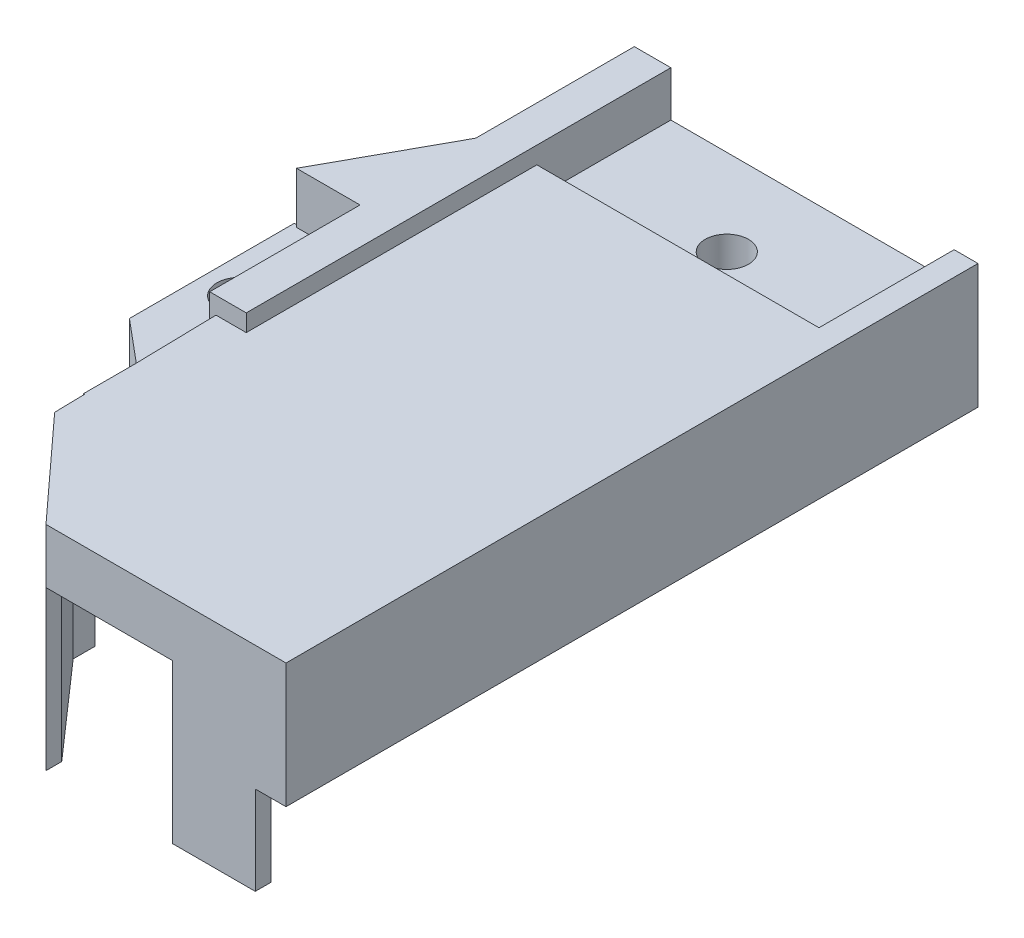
ISO-10303-21;
HEADER;
FILE_DESCRIPTION(('STEP AP214'),'2;1');
FILE_NAME('part.step','',(''),(''),'','','');
FILE_SCHEMA(('AUTOMOTIVE_DESIGN { 1 0 10303 214 1 1 1 1 }'));
ENDSEC;
DATA;
#1=APPLICATION_CONTEXT('core data for automotive mechanical design processes');
#2=APPLICATION_PROTOCOL_DEFINITION('international standard','automotive_design',2000,#1);
#3=PRODUCT_CONTEXT('',#1,'mechanical');
#4=PRODUCT('Part','Part','',(#3));
#5=PRODUCT_RELATED_PRODUCT_CATEGORY('part','',(#4));
#6=PRODUCT_DEFINITION_FORMATION('','',#4);
#7=PRODUCT_DEFINITION_CONTEXT('part definition',#1,'design');
#8=PRODUCT_DEFINITION('design','',#6,#7);
#9=PRODUCT_DEFINITION_SHAPE('','',#8);
#10=(LENGTH_UNIT() NAMED_UNIT(*) SI_UNIT(.MILLI.,.METRE.));
#11=(NAMED_UNIT(*) PLANE_ANGLE_UNIT() SI_UNIT($,.RADIAN.));
#12=(NAMED_UNIT(*) SI_UNIT($,.STERADIAN.) SOLID_ANGLE_UNIT());
#13=UNCERTAINTY_MEASURE_WITH_UNIT(LENGTH_MEASURE(1.E-05),#10,'distance_accuracy_value','');
#14=(GEOMETRIC_REPRESENTATION_CONTEXT(3) GLOBAL_UNCERTAINTY_ASSIGNED_CONTEXT((#13)) GLOBAL_UNIT_ASSIGNED_CONTEXT((#10,
#11,#12)) REPRESENTATION_CONTEXT('',''));
#15=CARTESIAN_POINT('',(0.,0.,0.));
#16=DIRECTION('',(0.,0.,1.));
#17=DIRECTION('',(1.,0.,0.));
#18=AXIS2_PLACEMENT_3D('',#15,#16,#17);
#19=CARTESIAN_POINT('',(0.,-3.6,0.));
#20=DIRECTION('',(0.,1.,0.));
#21=DIRECTION('',(0.,0.,1.));
#22=AXIS2_PLACEMENT_3D('',#19,#20,#21);
#23=PLANE('',#22);
#24=DIRECTION('',(-0.660340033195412,0.,-0.750966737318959));
#25=VECTOR('',#24,1.);
#26=CARTESIAN_POINT('',(21.3332644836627,-3.6,24.6395335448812));
#27=LINE('',#26,#25);
#28=CARTESIAN_POINT('',(26.6782633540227,-3.6,30.7180933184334));
#29=VERTEX_POINT('',#28);
#30=CARTESIAN_POINT('',(21.3332644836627,-3.6,24.6395335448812));
#31=VERTEX_POINT('',#30);
#32=EDGE_CURVE('E420',#29,#31,#27,.T.);
#33=ORIENTED_EDGE('',*,*,#32,.F.);
#34=DIRECTION('',(0.,0.,1.));
#35=VECTOR('',#34,1.);
#36=CARTESIAN_POINT('',(26.6782633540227,-3.6,0.));
#37=LINE('',#36,#35);
#38=CARTESIAN_POINT('',(26.6782633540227,-3.6,31.7234110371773));
#39=VERTEX_POINT('',#38);
#40=EDGE_CURVE('E44',#29,#39,#37,.T.);
#41=ORIENTED_EDGE('',*,*,#40,.T.);
#42=DIRECTION('',(0.675259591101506,0.,0.737580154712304));
#43=VECTOR('',#42,1.);
#44=CARTESIAN_POINT('',(26.6782633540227,-3.6,31.7234110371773));
#45=LINE('',#44,#43);
#46=CARTESIAN_POINT('',(20.7128923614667,-3.6,25.2074883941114));
#47=VERTEX_POINT('',#46);
#48=EDGE_CURVE('E416',#47,#39,#45,.T.);
#49=ORIENTED_EDGE('',*,*,#48,.F.);
#50=DIRECTION('',(0.0211800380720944,0.,0.999775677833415));
#51=VECTOR('',#50,1.);
#52=CARTESIAN_POINT('',(20.6710360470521,-3.6,23.2317164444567));
#53=LINE('',#52,#51);
#54=CARTESIAN_POINT('',(20.6710360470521,-3.6,23.2317164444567));
#55=VERTEX_POINT('',#54);
#56=EDGE_CURVE('E427',#55,#47,#53,.T.);
#57=ORIENTED_EDGE('',*,*,#56,.F.);
#58=DIRECTION('',(-1.,0.,0.));
#59=VECTOR('',#58,1.);
#60=CARTESIAN_POINT('',(21.3332644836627,-3.6,23.2317164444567));
#61=LINE('',#60,#59);
#62=CARTESIAN_POINT('',(21.3332644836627,-3.6,23.2317164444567));
#63=VERTEX_POINT('',#62);
#64=EDGE_CURVE('E431',#63,#55,#61,.T.);
#65=ORIENTED_EDGE('',*,*,#64,.F.);
#66=DIRECTION('',(0.,0.,-1.));
#67=VECTOR('',#66,1.);
#68=CARTESIAN_POINT('',(21.3332644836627,-3.6,24.6395335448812));
#69=LINE('',#68,#67);
#70=EDGE_CURVE('E815',#31,#63,#69,.T.);
#71=ORIENTED_EDGE('',*,*,#70,.F.);
#72=EDGE_LOOP('',(#33,#41,#49,#57,#65,#71));
#73=FACE_BOUND('',#72,.T.);
#74=ADVANCED_FACE('F36',(#73),#23,.F.);
#75=CARTESIAN_POINT('',(40.5649101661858,10.1,-12.7472741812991));
#76=DIRECTION('',(1.,0.,0.));
#77=DIRECTION('',(0.,0.,-1.));
#78=AXIS2_PLACEMENT_3D('',#75,#76,#77);
#79=PLANE('',#78);
#80=DIRECTION('',(0.,-1.,0.));
#81=VECTOR('',#80,1.);
#82=CARTESIAN_POINT('',(40.5649101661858,8.28643717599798,-4.33748524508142));
#83=LINE('',#82,#81);
#84=CARTESIAN_POINT('',(40.5649101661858,8.28643717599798,-4.33748524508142));
#85=VERTEX_POINT('',#84);
#86=CARTESIAN_POINT('',(40.5649101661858,6.74143460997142,-4.33748524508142));
#87=VERTEX_POINT('',#86);
#88=EDGE_CURVE('E631',#85,#87,#83,.T.);
#89=ORIENTED_EDGE('',*,*,#88,.T.);
#90=DIRECTION('',(0.,0.,-1.));
#91=VECTOR('',#90,1.);
#92=CARTESIAN_POINT('',(40.5649101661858,6.74143460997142,-2.67398141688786));
#93=LINE('',#92,#91);
#94=CARTESIAN_POINT('',(40.5649101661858,6.74143460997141,-12.6739814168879));
#95=VERTEX_POINT('',#94);
#96=EDGE_CURVE('E576',#87,#95,#93,.T.);
#97=ORIENTED_EDGE('',*,*,#96,.T.);
#98=DIRECTION('',(0.,1.,0.));
#99=VECTOR('',#98,1.);
#100=CARTESIAN_POINT('',(40.5649101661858,11.2,-12.6739814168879));
#101=LINE('',#100,#99);
#102=CARTESIAN_POINT('',(40.5649101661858,8.28643717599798,-12.6739814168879));
#103=VERTEX_POINT('',#102);
#104=EDGE_CURVE('E634',#95,#103,#101,.T.);
#105=ORIENTED_EDGE('',*,*,#104,.T.);
#106=DIRECTION('',(0.,0.,-1.));
#107=VECTOR('',#106,1.);
#108=CARTESIAN_POINT('',(40.5649101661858,8.28643717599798,0.));
#109=LINE('',#108,#107);
#110=EDGE_CURVE('E636',#85,#103,#109,.T.);
#111=ORIENTED_EDGE('',*,*,#110,.F.);
#112=EDGE_LOOP('',(#89,#97,#105,#111));
#113=FACE_BOUND('',#112,.T.);
#114=DIRECTION('',(0.,-1.,0.));
#115=VECTOR('',#114,1.);
#116=CARTESIAN_POINT('',(40.5649101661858,10.1,30.7234110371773));
#117=LINE('',#116,#115);
#118=CARTESIAN_POINT('',(40.5649101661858,7.1,30.7234110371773));
#119=VERTEX_POINT('',#118);
#120=CARTESIAN_POINT('',(40.5649101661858,2.1,30.7234110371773));
#121=VERTEX_POINT('',#120);
#122=EDGE_CURVE('E865',#119,#121,#117,.T.);
#123=ORIENTED_EDGE('',*,*,#122,.F.);
#124=DIRECTION('',(0.,0.,-1.));
#125=VECTOR('',#124,1.);
#126=CARTESIAN_POINT('',(40.5649101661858,7.1,-12.7472741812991));
#127=LINE('',#126,#125);
#128=CARTESIAN_POINT('',(40.5649101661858,7.1,-4.06052698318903));
#129=VERTEX_POINT('',#128);
#130=EDGE_CURVE('E530',#119,#129,#127,.T.);
#131=ORIENTED_EDGE('',*,*,#130,.T.);
#132=DIRECTION('',(0.,1.,0.));
#133=VECTOR('',#132,1.);
#134=CARTESIAN_POINT('',(40.5649101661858,10.1,-4.06052698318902));
#135=LINE('',#134,#133);
#136=CARTESIAN_POINT('',(40.5649101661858,10.1,-4.06052698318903));
#137=VERTEX_POINT('',#136);
#138=EDGE_CURVE('E517',#129,#137,#135,.T.);
#139=ORIENTED_EDGE('',*,*,#138,.T.);
#140=DIRECTION('',(0.,0.,1.));
#141=VECTOR('',#140,1.);
#142=CARTESIAN_POINT('',(40.5649101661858,10.1,-12.7472741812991));
#143=LINE('',#142,#141);
#144=CARTESIAN_POINT('',(40.5649101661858,10.1,-12.7472741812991));
#145=VERTEX_POINT('',#144);
#146=EDGE_CURVE('E609',#145,#137,#143,.T.);
#147=ORIENTED_EDGE('',*,*,#146,.F.);
#148=DIRECTION('',(0.,-1.,0.));
#149=VECTOR('',#148,1.);
#150=CARTESIAN_POINT('',(40.5649101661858,10.1,-12.7472741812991));
#151=LINE('',#150,#149);
#152=CARTESIAN_POINT('',(40.5649101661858,2.1,-12.7472741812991));
#153=VERTEX_POINT('',#152);
#154=EDGE_CURVE('E625',#145,#153,#151,.T.);
#155=ORIENTED_EDGE('',*,*,#154,.T.);
#156=DIRECTION('',(0.,0.,1.));
#157=VECTOR('',#156,1.);
#158=CARTESIAN_POINT('',(40.5649101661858,2.1,-12.7472741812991));
#159=LINE('',#158,#157);
#160=EDGE_CURVE('E619',#153,#121,#159,.T.);
#161=ORIENTED_EDGE('',*,*,#160,.T.);
#162=EDGE_LOOP('',(#123,#131,#139,#147,#155,#161));
#163=FACE_BOUND('',#162,.T.);
#164=ADVANCED_FACE('F928',(#113,#163),#79,.F.);
#165=CARTESIAN_POINT('',(0.,7.1,0.));
#166=DIRECTION('',(0.,-1.,0.));
#167=DIRECTION('',(0.,0.,-1.));
#168=AXIS2_PLACEMENT_3D('',#165,#166,#167);
#169=PLANE('',#168);
#170=DIRECTION('',(0.,0.,1.));
#171=VECTOR('',#170,1.);
#172=CARTESIAN_POINT('',(38.8154284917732,7.1,15.6960979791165));
#173=LINE('',#172,#171);
#174=CARTESIAN_POINT('',(38.8154284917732,7.1,6.8497101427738));
#175=VERTEX_POINT('',#174);
#176=CARTESIAN_POINT('',(38.8154284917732,7.1,15.6960979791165));
#177=VERTEX_POINT('',#176);
#178=EDGE_CURVE('E454',#175,#177,#173,.T.);
#179=ORIENTED_EDGE('',*,*,#178,.F.);
#180=DIRECTION('',(1.,0.,0.));
#181=VECTOR('',#180,1.);
#182=CARTESIAN_POINT('',(38.8154284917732,7.1,6.8497101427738));
#183=LINE('',#182,#181);
#184=CARTESIAN_POINT('',(24.4917637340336,7.1,6.8497101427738));
#185=VERTEX_POINT('',#184);
#186=EDGE_CURVE('E459',#185,#175,#183,.T.);
#187=ORIENTED_EDGE('',*,*,#186,.F.);
#188=DIRECTION('',(0.,0.,-1.));
#189=VECTOR('',#188,1.);
#190=CARTESIAN_POINT('',(24.4917637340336,7.1,15.6960979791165));
#191=LINE('',#190,#189);
#192=CARTESIAN_POINT('',(24.4917637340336,7.1,15.6960979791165));
#193=VERTEX_POINT('',#192);
#194=EDGE_CURVE('E473',#193,#185,#191,.T.);
#195=ORIENTED_EDGE('',*,*,#194,.F.);
#196=DIRECTION('',(-1.,0.,0.));
#197=VECTOR('',#196,1.);
#198=CARTESIAN_POINT('',(38.8154284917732,7.1,15.6960979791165));
#199=LINE('',#198,#197);
#200=EDGE_CURVE('E470',#177,#193,#199,.T.);
#201=ORIENTED_EDGE('',*,*,#200,.F.);
#202=EDGE_LOOP('',(#179,#187,#195,#201));
#203=FACE_BOUND('',#202,.T.);
#204=ORIENTED_EDGE('',*,*,#130,.F.);
#205=DIRECTION('',(-1.,0.,0.));
#206=VECTOR('',#205,1.);
#207=CARTESIAN_POINT('',(0.,7.1,30.7234110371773));
#208=LINE('',#207,#206);
#209=CARTESIAN_POINT('',(40.1221594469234,7.1,30.7234110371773));
#210=VERTEX_POINT('',#209);
#211=EDGE_CURVE('E847',#119,#210,#208,.T.);
#212=ORIENTED_EDGE('',*,*,#211,.T.);
#213=DIRECTION('',(0.,0.,1.));
#214=VECTOR('',#213,1.);
#215=CARTESIAN_POINT('',(40.1221594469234,7.1,0.));
#216=LINE('',#215,#214);
#217=CARTESIAN_POINT('',(40.1221594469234,7.1,30.7180933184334));
#218=VERTEX_POINT('',#217);
#219=EDGE_CURVE('E783',#218,#210,#216,.T.);
#220=ORIENTED_EDGE('',*,*,#219,.F.);
#221=DIRECTION('',(1.,0.,0.));
#222=VECTOR('',#221,1.);
#223=CARTESIAN_POINT('',(0.,7.1,30.7180933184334));
#224=LINE('',#223,#222);
#225=CARTESIAN_POINT('',(26.6782633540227,7.1,30.7180933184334));
#226=VERTEX_POINT('',#225);
#227=EDGE_CURVE('E773',#226,#218,#224,.T.);
#228=ORIENTED_EDGE('',*,*,#227,.F.);
#229=DIRECTION('',(0.660340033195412,0.,0.750966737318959));
#230=VECTOR('',#229,1.);
#231=CARTESIAN_POINT('',(-0.187665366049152,7.1,0.165017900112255));
#232=LINE('',#231,#230);
#233=CARTESIAN_POINT('',(21.3332644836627,7.1,24.6395335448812));
#234=VERTEX_POINT('',#233);
#235=EDGE_CURVE('E778',#234,#226,#232,.T.);
#236=ORIENTED_EDGE('',*,*,#235,.F.);
#237=DIRECTION('',(0.,0.,1.));
#238=VECTOR('',#237,1.);
#239=CARTESIAN_POINT('',(21.3332644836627,7.1,0.));
#240=LINE('',#239,#238);
#241=CARTESIAN_POINT('',(21.3332644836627,7.1,23.2318510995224));
#242=VERTEX_POINT('',#241);
#243=EDGE_CURVE('E781',#242,#234,#240,.T.);
#244=ORIENTED_EDGE('',*,*,#243,.F.);
#245=DIRECTION('',(-1.,0.,0.));
#246=VECTOR('',#245,1.);
#247=CARTESIAN_POINT('',(0.,7.1,23.2318510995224));
#248=LINE('',#247,#246);
#249=CARTESIAN_POINT('',(21.5458824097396,7.1,23.2318510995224));
#250=VERTEX_POINT('',#249);
#251=EDGE_CURVE('E902',#250,#242,#248,.T.);
#252=ORIENTED_EDGE('',*,*,#251,.F.);
#253=DIRECTION('',(0.,0.,1.));
#254=VECTOR('',#253,1.);
#255=CARTESIAN_POINT('',(21.5458824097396,7.1,0.));
#256=LINE('',#255,#254);
#257=CARTESIAN_POINT('',(21.5458824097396,7.1,19.9109650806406));
#258=VERTEX_POINT('',#257);
#259=EDGE_CURVE('E791',#258,#250,#256,.T.);
#260=ORIENTED_EDGE('',*,*,#259,.F.);
#261=DIRECTION('',(1.,0.,0.));
#262=VECTOR('',#261,1.);
#263=CARTESIAN_POINT('',(0.,7.1,19.9109650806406));
#264=LINE('',#263,#262);
#265=CARTESIAN_POINT('',(20.600686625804,7.1,19.9109650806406));
#266=VERTEX_POINT('',#265);
#267=EDGE_CURVE('E793',#266,#258,#264,.T.);
#268=ORIENTED_EDGE('',*,*,#267,.F.);
#269=DIRECTION('',(0.0211800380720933,0.,0.999775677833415));
#270=VECTOR('',#269,1.);
#271=CARTESIAN_POINT('',(20.7128923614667,7.1,25.2074883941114));
#272=LINE('',#271,#270);
#273=CARTESIAN_POINT('',(20.5916148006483,7.1,19.4827415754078));
#274=VERTEX_POINT('',#273);
#275=EDGE_CURVE('E493',#274,#266,#272,.T.);
#276=ORIENTED_EDGE('',*,*,#275,.F.);
#277=DIRECTION('',(-0.766838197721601,0.,-0.64184046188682));
#278=VECTOR('',#277,1.);
#279=CARTESIAN_POINT('',(15.7039696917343,7.1,15.3918024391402));
#280=LINE('',#279,#278);
#281=CARTESIAN_POINT('',(20.8933399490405,7.1,19.7352843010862));
#282=VERTEX_POINT('',#281);
#283=EDGE_CURVE('E539',#282,#274,#280,.T.);
#284=ORIENTED_EDGE('',*,*,#283,.F.);
#285=DIRECTION('',(0.100232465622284,0.,0.9949640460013));
#286=VECTOR('',#285,1.);
#287=CARTESIAN_POINT('',(20.8933399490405,7.1,19.7352843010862));
#288=LINE('',#287,#286);
#289=CARTESIAN_POINT('',(20.5180428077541,7.1,16.0098729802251));
#290=VERTEX_POINT('',#289);
#291=EDGE_CURVE('E536',#290,#282,#288,.T.);
#292=ORIENTED_EDGE('',*,*,#291,.F.);
#293=CARTESIAN_POINT('',(20.4884808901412,7.1,14.6144417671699));
#294=VERTEX_POINT('',#293);
#295=EDGE_CURVE('E497',#294,#290,#272,.T.);
#296=ORIENTED_EDGE('',*,*,#295,.F.);
#297=DIRECTION('',(-1.,0.,0.));
#298=VECTOR('',#297,1.);
#299=CARTESIAN_POINT('',(20.0861205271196,7.1,14.6144417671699));
#300=LINE('',#299,#298);
#301=CARTESIAN_POINT('',(22.4340728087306,7.1,14.6144417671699));
#302=VERTEX_POINT('',#301);
#303=EDGE_CURVE('E534',#302,#294,#300,.T.);
#304=ORIENTED_EDGE('',*,*,#303,.F.);
#305=DIRECTION('',(0.,0.,1.));
#306=VECTOR('',#305,1.);
#307=CARTESIAN_POINT('',(22.4340728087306,7.1,14.6144417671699));
#308=LINE('',#307,#306);
#309=CARTESIAN_POINT('',(22.4340728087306,7.1,-4.06052698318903));
#310=VERTEX_POINT('',#309);
#311=EDGE_CURVE('E532',#310,#302,#308,.T.);
#312=ORIENTED_EDGE('',*,*,#311,.F.);
#313=DIRECTION('',(-1.,0.,0.));
#314=VECTOR('',#313,1.);
#315=CARTESIAN_POINT('',(20.4735287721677,7.1,-4.06052698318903));
#316=LINE('',#315,#314);
#317=EDGE_CURVE('E490',#129,#310,#316,.T.);
#318=ORIENTED_EDGE('',*,*,#317,.F.);
#319=EDGE_LOOP('',(#204,#212,#220,#228,#236,#244,#252,#260,#268,#276,#284,#292,#296,#304,#312,#318));
#320=FACE_BOUND('',#319,.T.);
#321=ADVANCED_FACE('F845',(#203,#320),#169,.T.);
#322=CARTESIAN_POINT('',(20.7128923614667,7.1,25.2074883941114));
#323=DIRECTION('',(-0.999775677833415,0.,0.0211800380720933));
#324=DIRECTION('',(0.0211800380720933,0.,0.999775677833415));
#325=AXIS2_PLACEMENT_3D('',#322,#323,#324);
#326=PLANE('',#325);
#327=DIRECTION('',(0.,1.,0.));
#328=VECTOR('',#327,1.);
#329=CARTESIAN_POINT('',(20.600686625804,-1.6,19.9109650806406));
#330=LINE('',#329,#328);
#331=CARTESIAN_POINT('',(20.600686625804,10.1,19.9109650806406));
#332=VERTEX_POINT('',#331);
#333=EDGE_CURVE('E890',#266,#332,#330,.T.);
#334=ORIENTED_EDGE('',*,*,#333,.T.);
#335=DIRECTION('',(0.0211800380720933,0.,0.999775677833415));
#336=VECTOR('',#335,1.);
#337=CARTESIAN_POINT('',(20.7128923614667,10.1,25.2074883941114));
#338=LINE('',#337,#336);
#339=CARTESIAN_POINT('',(20.4884808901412,10.1,14.6144417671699));
#340=VERTEX_POINT('',#339);
#341=EDGE_CURVE('E509',#340,#332,#338,.T.);
#342=ORIENTED_EDGE('',*,*,#341,.F.);
#343=DIRECTION('',(0.,1.,0.));
#344=VECTOR('',#343,1.);
#345=CARTESIAN_POINT('',(20.4884808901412,11.2,14.6144417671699));
#346=LINE('',#345,#344);
#347=EDGE_CURVE('E771',#294,#340,#346,.T.);
#348=ORIENTED_EDGE('',*,*,#347,.F.);
#349=ORIENTED_EDGE('',*,*,#295,.T.);
#350=DIRECTION('',(0.,-1.,0.));
#351=VECTOR('',#350,1.);
#352=CARTESIAN_POINT('',(20.5180428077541,7.91103086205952,16.0098729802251));
#353=LINE('',#352,#351);
#354=CARTESIAN_POINT('',(20.5180428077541,7.91103086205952,16.0098729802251));
#355=VERTEX_POINT('',#354);
#356=EDGE_CURVE('E542',#355,#290,#353,.T.);
#357=ORIENTED_EDGE('',*,*,#356,.F.);
#358=DIRECTION('',(0.0211800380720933,0.,0.999775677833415));
#359=VECTOR('',#358,1.);
#360=CARTESIAN_POINT('',(20.1698248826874,7.91103086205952,-0.427293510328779));
#361=LINE('',#360,#359);
#362=CARTESIAN_POINT('',(20.5916148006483,7.91103086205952,19.4827415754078));
#363=VERTEX_POINT('',#362);
#364=EDGE_CURVE('E545',#355,#363,#361,.T.);
#365=ORIENTED_EDGE('',*,*,#364,.T.);
#366=DIRECTION('',(0.,1.,0.));
#367=VECTOR('',#366,1.);
#368=CARTESIAN_POINT('',(20.5916148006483,7.91103086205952,19.4827415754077));
#369=LINE('',#368,#367);
#370=EDGE_CURVE('E547',#274,#363,#369,.T.);
#371=ORIENTED_EDGE('',*,*,#370,.F.);
#372=ORIENTED_EDGE('',*,*,#275,.T.);
#373=EDGE_LOOP('',(#334,#342,#348,#349,#357,#365,#371,#372));
#374=FACE_BOUND('',#373,.T.);
#375=ADVANCED_FACE('F983',(#374),#326,.T.);
#376=CARTESIAN_POINT('',(21.3332644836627,-3.6,23.2317164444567));
#377=DIRECTION('',(0.,0.,-1.));
#378=DIRECTION('',(-1.,0.,0.));
#379=AXIS2_PLACEMENT_3D('',#376,#377,#378);
#380=PLANE('',#379);
#381=DIRECTION('',(0.,1.,0.));
#382=VECTOR('',#381,1.);
#383=CARTESIAN_POINT('',(20.6710360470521,-3.6,23.2317164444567));
#384=LINE('',#383,#382);
#385=CARTESIAN_POINT('',(20.6710360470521,-1.6,23.2317164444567));
#386=VERTEX_POINT('',#385);
#387=EDGE_CURVE('E439',#55,#386,#384,.T.);
#388=ORIENTED_EDGE('',*,*,#387,.T.);
#389=DIRECTION('',(1.,0.,0.));
#390=VECTOR('',#389,1.);
#391=CARTESIAN_POINT('',(21.3332644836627,-1.6,23.2317164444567));
#392=LINE('',#391,#390);
#393=CARTESIAN_POINT('',(21.3332644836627,-1.6,23.2317164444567));
#394=VERTEX_POINT('',#393);
#395=EDGE_CURVE('E889',#386,#394,#392,.T.);
#396=ORIENTED_EDGE('',*,*,#395,.T.);
#397=DIRECTION('',(0.,1.,0.));
#398=VECTOR('',#397,1.);
#399=CARTESIAN_POINT('',(21.3332644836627,-3.6,23.2317164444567));
#400=LINE('',#399,#398);
#401=EDGE_CURVE('E442',#63,#394,#400,.T.);
#402=ORIENTED_EDGE('',*,*,#401,.F.);
#403=ORIENTED_EDGE('',*,*,#64,.T.);
#404=EDGE_LOOP('',(#388,#396,#402,#403));
#405=FACE_BOUND('',#404,.T.);
#406=ADVANCED_FACE('F825',(#405),#380,.T.);
#407=DIRECTION('',(-0.675259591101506,0.,-0.737580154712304));
#408=VECTOR('',#407,1.);
#409=CARTESIAN_POINT('',(-1.2864725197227,7.1,1.17777424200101));
#410=LINE('',#409,#408);
#411=CARTESIAN_POINT('',(26.6782633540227,7.1,31.7234110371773));
#412=VERTEX_POINT('',#411);
#413=CARTESIAN_POINT('',(20.7128923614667,7.1,25.2074883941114));
#414=VERTEX_POINT('',#413);
#415=EDGE_CURVE('E436',#412,#414,#410,.T.);
#416=ORIENTED_EDGE('',*,*,#415,.F.);
#417=DIRECTION('',(1.,0.,0.));
#418=VECTOR('',#417,1.);
#419=CARTESIAN_POINT('',(42.09860872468,7.1,31.7234110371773));
#420=LINE('',#419,#418);
#421=CARTESIAN_POINT('',(26.6737863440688,7.1,31.7234110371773));
#422=VERTEX_POINT('',#421);
#423=EDGE_CURVE('E501',#422,#412,#420,.T.);
#424=ORIENTED_EDGE('',*,*,#423,.F.);
#425=DIRECTION('',(0.674983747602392,0.,0.737832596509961));
#426=VECTOR('',#425,1.);
#427=CARTESIAN_POINT('',(26.6737863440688,7.1,31.7234110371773));
#428=LINE('',#427,#426);
#429=EDGE_CURVE('E498',#414,#422,#428,.T.);
#430=ORIENTED_EDGE('',*,*,#429,.F.);
#431=EDGE_LOOP('',(#416,#424,#430));
#432=FACE_BOUND('',#431,.T.);
#433=ADVANCED_FACE('F1062',(#432),#169,.T.);
#434=CARTESIAN_POINT('',(20.0861205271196,11.2,-12.6739814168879));
#435=DIRECTION('',(0.,0.,1.));
#436=DIRECTION('',(1.,0.,0.));
#437=AXIS2_PLACEMENT_3D('',#434,#435,#436);
#438=PLANE('',#437);
#439=ORIENTED_EDGE('',*,*,#104,.F.);
#440=DIRECTION('',(1.,0.,0.));
#441=VECTOR('',#440,1.);
#442=CARTESIAN_POINT('',(40.5649101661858,6.74143460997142,-12.6739814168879));
#443=LINE('',#442,#441);
#444=CARTESIAN_POINT('',(33.8506896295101,6.74143460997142,-12.6739814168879));
#445=VERTEX_POINT('',#444);
#446=EDGE_CURVE('E554',#445,#95,#443,.T.);
#447=ORIENTED_EDGE('',*,*,#446,.F.);
#448=DIRECTION('',(0.,1.,0.));
#449=VECTOR('',#448,1.);
#450=CARTESIAN_POINT('',(33.8506896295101,6.74143460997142,-12.6739814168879));
#451=LINE('',#450,#449);
#452=CARTESIAN_POINT('',(33.8506896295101,4.09346618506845,-12.6739814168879));
#453=VERTEX_POINT('',#452);
#454=EDGE_CURVE('E572',#453,#445,#451,.T.);
#455=ORIENTED_EDGE('',*,*,#454,.F.);
#456=DIRECTION('',(1.,0.,0.));
#457=VECTOR('',#456,1.);
#458=CARTESIAN_POINT('',(33.8506896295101,4.09346618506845,-12.6739814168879));
#459=LINE('',#458,#457);
#460=CARTESIAN_POINT('',(29.6981836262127,4.09346618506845,-12.6739814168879));
#461=VERTEX_POINT('',#460);
#462=EDGE_CURVE('E569',#461,#453,#459,.T.);
#463=ORIENTED_EDGE('',*,*,#462,.F.);
#464=DIRECTION('',(0.,-1.,0.));
#465=VECTOR('',#464,1.);
#466=CARTESIAN_POINT('',(29.6981836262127,6.74143460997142,-12.6739814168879));
#467=LINE('',#466,#465);
#468=CARTESIAN_POINT('',(29.6981836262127,6.74143460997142,-12.6739814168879));
#469=VERTEX_POINT('',#468);
#470=EDGE_CURVE('E566',#469,#461,#467,.T.);
#471=ORIENTED_EDGE('',*,*,#470,.F.);
#472=DIRECTION('',(1.,0.,0.));
#473=VECTOR('',#472,1.);
#474=CARTESIAN_POINT('',(29.6981836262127,6.74143460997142,-12.6739814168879));
#475=LINE('',#474,#473);
#476=CARTESIAN_POINT('',(21.9300156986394,6.74143460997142,-12.6739814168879));
#477=VERTEX_POINT('',#476);
#478=EDGE_CURVE('E563',#477,#469,#475,.T.);
#479=ORIENTED_EDGE('',*,*,#478,.F.);
#480=DIRECTION('',(0.,1.,0.));
#481=VECTOR('',#480,1.);
#482=CARTESIAN_POINT('',(21.9300156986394,6.74143460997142,-12.6739814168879));
#483=LINE('',#482,#481);
#484=CARTESIAN_POINT('',(21.9300156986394,3.2,-12.6739814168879));
#485=VERTEX_POINT('',#484);
#486=EDGE_CURVE('E550',#485,#477,#483,.T.);
#487=ORIENTED_EDGE('',*,*,#486,.F.);
#488=DIRECTION('',(-1.,0.,0.));
#489=VECTOR('',#488,1.);
#490=CARTESIAN_POINT('',(20.0861205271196,3.2,-12.6739814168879));
#491=LINE('',#490,#489);
#492=CARTESIAN_POINT('',(20.0861205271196,3.2,-12.6739814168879));
#493=VERTEX_POINT('',#492);
#494=EDGE_CURVE('E673',#485,#493,#491,.T.);
#495=ORIENTED_EDGE('',*,*,#494,.T.);
#496=DIRECTION('',(0.,-1.,0.));
#497=VECTOR('',#496,1.);
#498=CARTESIAN_POINT('',(20.0861205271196,11.2,-12.6739814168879));
#499=LINE('',#498,#497);
#500=CARTESIAN_POINT('',(20.0861205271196,11.2,-12.6739814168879));
#501=VERTEX_POINT('',#500);
#502=EDGE_CURVE('E686',#501,#493,#499,.T.);
#503=ORIENTED_EDGE('',*,*,#502,.F.);
#504=DIRECTION('',(-1.,0.,0.));
#505=VECTOR('',#504,1.);
#506=CARTESIAN_POINT('',(20.0861205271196,11.2,-12.6739814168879));
#507=LINE('',#506,#505);
#508=CARTESIAN_POINT('',(22.4340728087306,11.2,-12.6739814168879));
#509=VERTEX_POINT('',#508);
#510=EDGE_CURVE('E659',#509,#501,#507,.T.);
#511=ORIENTED_EDGE('',*,*,#510,.F.);
#512=DIRECTION('',(0.,-1.,0.));
#513=VECTOR('',#512,1.);
#514=CARTESIAN_POINT('',(22.4340728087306,11.2,-12.6739814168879));
#515=LINE('',#514,#513);
#516=CARTESIAN_POINT('',(22.4340728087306,8.28643717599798,-12.6739814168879));
#517=VERTEX_POINT('',#516);
#518=EDGE_CURVE('E689',#509,#517,#515,.T.);
#519=ORIENTED_EDGE('',*,*,#518,.T.);
#520=DIRECTION('',(-1.,0.,0.));
#521=VECTOR('',#520,1.);
#522=CARTESIAN_POINT('',(20.9329156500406,8.28643717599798,-12.6739814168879));
#523=LINE('',#522,#521);
#524=EDGE_CURVE('E645',#103,#517,#523,.T.);
#525=ORIENTED_EDGE('',*,*,#524,.F.);
#526=EDGE_LOOP('',(#439,#447,#455,#463,#471,#479,#487,#495,#503,#511,#519,#525));
#527=FACE_BOUND('',#526,.T.);
#528=ADVANCED_FACE('F972',(#527),#438,.F.);
#529=CARTESIAN_POINT('',(20.9329156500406,8.28643717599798,-4.33748524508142));
#530=DIRECTION('',(0.,0.,-1.));
#531=DIRECTION('',(-1.,0.,0.));
#532=AXIS2_PLACEMENT_3D('',#529,#530,#531);
#533=PLANE('',#532);
#534=DIRECTION('',(0.,1.,0.));
#535=VECTOR('',#534,1.);
#536=CARTESIAN_POINT('',(33.8506896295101,8.28643717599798,-4.33748524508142));
#537=LINE('',#536,#535);
#538=CARTESIAN_POINT('',(33.8506896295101,4.09346618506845,-4.33748524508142));
#539=VERTEX_POINT('',#538);
#540=CARTESIAN_POINT('',(33.8506896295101,6.74143460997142,-4.33748524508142));
#541=VERTEX_POINT('',#540);
#542=EDGE_CURVE('E768',#539,#541,#537,.T.);
#543=ORIENTED_EDGE('',*,*,#542,.T.);
#544=DIRECTION('',(1.,0.,0.));
#545=VECTOR('',#544,1.);
#546=CARTESIAN_POINT('',(20.9329156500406,6.74143460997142,-4.33748524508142));
#547=LINE('',#546,#545);
#548=EDGE_CURVE('E592',#541,#87,#547,.T.);
#549=ORIENTED_EDGE('',*,*,#548,.T.);
#550=ORIENTED_EDGE('',*,*,#88,.F.);
#551=DIRECTION('',(1.,0.,0.));
#552=VECTOR('',#551,1.);
#553=CARTESIAN_POINT('',(20.9329156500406,8.28643717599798,-4.33748524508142));
#554=LINE('',#553,#552);
#555=CARTESIAN_POINT('',(22.4340728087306,8.28643717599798,-4.33748524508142));
#556=VERTEX_POINT('',#555);
#557=EDGE_CURVE('E642',#556,#85,#554,.T.);
#558=ORIENTED_EDGE('',*,*,#557,.F.);
#559=DIRECTION('',(0.,-1.,0.));
#560=VECTOR('',#559,1.);
#561=CARTESIAN_POINT('',(22.4340728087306,11.2,-4.33748524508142));
#562=LINE('',#561,#560);
#563=CARTESIAN_POINT('',(22.4340728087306,6.74143460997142,-4.33748524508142));
#564=VERTEX_POINT('',#563);
#565=EDGE_CURVE('E757',#556,#564,#562,.T.);
#566=ORIENTED_EDGE('',*,*,#565,.T.);
#567=DIRECTION('',(1.,0.,0.));
#568=VECTOR('',#567,1.);
#569=CARTESIAN_POINT('',(20.9329156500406,6.74143460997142,-4.33748524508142));
#570=LINE('',#569,#568);
#571=CARTESIAN_POINT('',(29.6981836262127,6.74143460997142,-4.33748524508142));
#572=VERTEX_POINT('',#571);
#573=EDGE_CURVE('E599',#564,#572,#570,.T.);
#574=ORIENTED_EDGE('',*,*,#573,.T.);
#575=DIRECTION('',(0.,-1.,0.));
#576=VECTOR('',#575,1.);
#577=CARTESIAN_POINT('',(29.6981836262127,8.28643717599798,-4.33748524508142));
#578=LINE('',#577,#576);
#579=CARTESIAN_POINT('',(29.6981836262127,4.09346618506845,-4.33748524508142));
#580=VERTEX_POINT('',#579);
#581=EDGE_CURVE('E765',#572,#580,#578,.T.);
#582=ORIENTED_EDGE('',*,*,#581,.T.);
#583=DIRECTION('',(1.,0.,0.));
#584=VECTOR('',#583,1.);
#585=CARTESIAN_POINT('',(20.9329156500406,4.09346618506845,-4.33748524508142));
#586=LINE('',#585,#584);
#587=EDGE_CURVE('E596',#580,#539,#586,.T.);
#588=ORIENTED_EDGE('',*,*,#587,.T.);
#589=EDGE_LOOP('',(#543,#549,#550,#558,#566,#574,#582,#588));
#590=FACE_BOUND('',#589,.T.);
#591=ADVANCED_FACE('F963',(#590),#533,.F.);
#592=CARTESIAN_POINT('',(0.,8.28643717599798,0.));
#593=DIRECTION('',(0.,1.,0.));
#594=DIRECTION('',(0.,0.,1.));
#595=AXIS2_PLACEMENT_3D('',#592,#593,#594);
#596=PLANE('',#595);
#597=CARTESIAN_POINT('',(31.5636109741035,8.28643717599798,-7.13864078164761));
#598=DIRECTION('',(0.,1.,0.));
#599=DIRECTION('',(0.,0.,1.));
#600=AXIS2_PLACEMENT_3D('',#597,#598,#599);
#601=CIRCLE('',#600,1.39106610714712);
#602=CARTESIAN_POINT('',(31.5636109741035,8.28643717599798,-5.74757467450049));
#603=VERTEX_POINT('',#602);
#604=EDGE_CURVE('E639',#603,#603,#601,.T.);
#605=ORIENTED_EDGE('',*,*,#604,.F.);
#606=EDGE_LOOP('',(#605));
#607=FACE_BOUND('',#606,.T.);
#608=ORIENTED_EDGE('',*,*,#557,.T.);
#609=ORIENTED_EDGE('',*,*,#110,.T.);
#610=ORIENTED_EDGE('',*,*,#524,.T.);
#611=DIRECTION('',(0.,0.,-1.));
#612=VECTOR('',#611,1.);
#613=CARTESIAN_POINT('',(22.4340728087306,8.28643717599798,14.6144417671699));
#614=LINE('',#613,#612);
#615=EDGE_CURVE('E647',#556,#517,#614,.T.);
#616=ORIENTED_EDGE('',*,*,#615,.F.);
#617=EDGE_LOOP('',(#608,#609,#610,#616));
#618=FACE_BOUND('',#617,.T.);
#619=ADVANCED_FACE('F1109',(#607,#618),#596,.T.);
#620=CARTESIAN_POINT('',(20.4735287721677,7.91103086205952,4.79834341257));
#621=DIRECTION('',(-1.,0.,0.));
#622=DIRECTION('',(0.,0.,1.));
#623=AXIS2_PLACEMENT_3D('',#620,#621,#622);
#624=PLANE('',#623);
#625=DIRECTION('',(0.,-1.,0.));
#626=VECTOR('',#625,1.);
#627=CARTESIAN_POINT('',(20.4735287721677,7.91103086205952,14.6144417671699));
#628=LINE('',#627,#626);
#629=CARTESIAN_POINT('',(20.4735287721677,7.91103086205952,14.6144417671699));
#630=VERTEX_POINT('',#629);
#631=CARTESIAN_POINT('',(20.4735287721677,3.2,14.6144417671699));
#632=VERTEX_POINT('',#631);
#633=EDGE_CURVE('E700',#630,#632,#628,.T.);
#634=ORIENTED_EDGE('',*,*,#633,.F.);
#635=DIRECTION('',(0.,0.,-1.));
#636=VECTOR('',#635,1.);
#637=CARTESIAN_POINT('',(20.4735287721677,7.91103086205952,15.5680015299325));
#638=LINE('',#637,#636);
#639=CARTESIAN_POINT('',(20.4735287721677,7.91103086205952,15.5680015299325));
#640=VERTEX_POINT('',#639);
#641=EDGE_CURVE('E713',#640,#630,#638,.T.);
#642=ORIENTED_EDGE('',*,*,#641,.F.);
#643=DIRECTION('',(0.,-1.,0.));
#644=VECTOR('',#643,1.);
#645=CARTESIAN_POINT('',(20.4735287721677,7.91103086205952,15.5680015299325));
#646=LINE('',#645,#644);
#647=CARTESIAN_POINT('',(20.4735287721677,1.41103086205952,15.5680015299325));
#648=VERTEX_POINT('',#647);
#649=EDGE_CURVE('E735',#640,#648,#646,.T.);
#650=ORIENTED_EDGE('',*,*,#649,.T.);
#651=DIRECTION('',(0.,0.,-1.));
#652=VECTOR('',#651,1.);
#653=CARTESIAN_POINT('',(20.4735287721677,1.41103086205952,4.79834341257));
#654=LINE('',#653,#652);
#655=CARTESIAN_POINT('',(20.4735287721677,1.41103086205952,4.79834341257));
#656=VERTEX_POINT('',#655);
#657=EDGE_CURVE('E726',#648,#656,#654,.T.);
#658=ORIENTED_EDGE('',*,*,#657,.T.);
#659=DIRECTION('',(0.,-1.,0.));
#660=VECTOR('',#659,1.);
#661=CARTESIAN_POINT('',(20.4735287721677,7.91103086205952,4.79834341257));
#662=LINE('',#661,#660);
#663=CARTESIAN_POINT('',(20.4735287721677,3.2,4.79834341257));
#664=VERTEX_POINT('',#663);
#665=EDGE_CURVE('E733',#664,#656,#662,.T.);
#666=ORIENTED_EDGE('',*,*,#665,.F.);
#667=DIRECTION('',(0.,0.,-1.));
#668=VECTOR('',#667,1.);
#669=CARTESIAN_POINT('',(20.4735287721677,3.2,4.79834341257));
#670=LINE('',#669,#668);
#671=EDGE_CURVE('E702',#632,#664,#670,.T.);
#672=ORIENTED_EDGE('',*,*,#671,.F.);
#673=EDGE_LOOP('',(#634,#642,#650,#658,#666,#672));
#674=FACE_BOUND('',#673,.T.);
#675=ADVANCED_FACE('F1112',(#674),#624,.F.);
#676=CARTESIAN_POINT('',(15.7039696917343,7.91103086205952,4.79834341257));
#677=DIRECTION('',(0.,0.,1.));
#678=DIRECTION('',(1.,0.,0.));
#679=AXIS2_PLACEMENT_3D('',#676,#677,#678);
#680=PLANE('',#679);
#681=DIRECTION('',(0.,1.,0.));
#682=VECTOR('',#681,1.);
#683=CARTESIAN_POINT('',(16.0880591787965,7.91103086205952,4.79834341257));
#684=LINE('',#683,#682);
#685=CARTESIAN_POINT('',(16.0880591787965,3.2,4.79834341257));
#686=VERTEX_POINT('',#685);
#687=CARTESIAN_POINT('',(16.0880591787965,7.91103086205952,4.79834341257));
#688=VERTEX_POINT('',#687);
#689=EDGE_CURVE('E698',#686,#688,#684,.T.);
#690=ORIENTED_EDGE('',*,*,#689,.F.);
#691=DIRECTION('',(-1.,0.,0.));
#692=VECTOR('',#691,1.);
#693=CARTESIAN_POINT('',(15.7039696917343,3.2,4.79834341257));
#694=LINE('',#693,#692);
#695=EDGE_CURVE('E755',#664,#686,#694,.T.);
#696=ORIENTED_EDGE('',*,*,#695,.F.);
#697=ORIENTED_EDGE('',*,*,#665,.T.);
#698=DIRECTION('',(-1.,0.,0.));
#699=VECTOR('',#698,1.);
#700=CARTESIAN_POINT('',(15.7039696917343,1.41103086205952,4.79834341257));
#701=LINE('',#700,#699);
#702=CARTESIAN_POINT('',(15.7039696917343,1.41103086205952,4.79834341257));
#703=VERTEX_POINT('',#702);
#704=EDGE_CURVE('E708',#656,#703,#701,.T.);
#705=ORIENTED_EDGE('',*,*,#704,.T.);
#706=DIRECTION('',(0.,-1.,0.));
#707=VECTOR('',#706,1.);
#708=CARTESIAN_POINT('',(15.7039696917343,7.91103086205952,4.79834341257));
#709=LINE('',#708,#707);
#710=CARTESIAN_POINT('',(15.7039696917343,7.91103086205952,4.79834341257));
#711=VERTEX_POINT('',#710);
#712=EDGE_CURVE('E718',#711,#703,#709,.T.);
#713=ORIENTED_EDGE('',*,*,#712,.F.);
#714=DIRECTION('',(-1.,0.,0.));
#715=VECTOR('',#714,1.);
#716=CARTESIAN_POINT('',(15.7039696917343,7.91103086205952,4.79834341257));
#717=LINE('',#716,#715);
#718=EDGE_CURVE('E716',#688,#711,#717,.T.);
#719=ORIENTED_EDGE('',*,*,#718,.F.);
#720=EDGE_LOOP('',(#690,#696,#697,#705,#713,#719));
#721=FACE_BOUND('',#720,.T.);
#722=ADVANCED_FACE('F1146',(#721),#680,.F.);
#723=CARTESIAN_POINT('',(0.,7.91103086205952,0.));
#724=DIRECTION('',(0.,1.,0.));
#725=DIRECTION('',(0.,0.,1.));
#726=AXIS2_PLACEMENT_3D('',#723,#724,#725);
#727=PLANE('',#726);
#728=CARTESIAN_POINT('',(17.9895518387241,7.91103086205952,10.5897190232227));
#729=DIRECTION('',(0.,1.,0.));
#730=DIRECTION('',(0.,0.,1.));
#731=AXIS2_PLACEMENT_3D('',#728,#729,#730);
#732=CIRCLE('',#731,1.46136398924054);
#733=CARTESIAN_POINT('',(17.9895518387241,7.91103086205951,12.0510830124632));
#734=VERTEX_POINT('',#733);
#735=EDGE_CURVE('E480',#734,#734,#732,.T.);
#736=ORIENTED_EDGE('',*,*,#735,.F.);
#737=EDGE_LOOP('',(#736));
#738=FACE_BOUND('',#737,.T.);
#739=ORIENTED_EDGE('',*,*,#364,.F.);
#740=DIRECTION('',(-0.100232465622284,0.,-0.9949640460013));
#741=VECTOR('',#740,1.);
#742=CARTESIAN_POINT('',(20.8933399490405,7.91103086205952,19.7352843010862));
#743=LINE('',#742,#741);
#744=EDGE_CURVE('E711',#355,#640,#743,.T.);
#745=ORIENTED_EDGE('',*,*,#744,.T.);
#746=ORIENTED_EDGE('',*,*,#641,.T.);
#747=DIRECTION('',(-1.,0.,0.));
#748=VECTOR('',#747,1.);
#749=CARTESIAN_POINT('',(0.,7.91103086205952,14.6144417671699));
#750=LINE('',#749,#748);
#751=CARTESIAN_POINT('',(20.0861205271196,7.91103086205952,14.6144417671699));
#752=VERTEX_POINT('',#751);
#753=EDGE_CURVE('E752',#630,#752,#750,.T.);
#754=ORIENTED_EDGE('',*,*,#753,.T.);
#755=DIRECTION('',(0.,0.,-1.));
#756=VECTOR('',#755,1.);
#757=CARTESIAN_POINT('',(20.0861205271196,7.91103086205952,0.));
#758=LINE('',#757,#756);
#759=CARTESIAN_POINT('',(20.0861205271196,7.91103086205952,4.95350703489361));
#760=VERTEX_POINT('',#759);
#761=EDGE_CURVE('E749',#752,#760,#758,.T.);
#762=ORIENTED_EDGE('',*,*,#761,.T.);
#763=DIRECTION('',(-1.,0.,0.));
#764=VECTOR('',#763,1.);
#765=CARTESIAN_POINT('',(0.,7.91103086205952,4.95350703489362));
#766=LINE('',#765,#764);
#767=CARTESIAN_POINT('',(16.0028882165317,7.91103086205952,4.95350703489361));
#768=VERTEX_POINT('',#767);
#769=EDGE_CURVE('E743',#760,#768,#766,.T.);
#770=ORIENTED_EDGE('',*,*,#769,.T.);
#771=DIRECTION('',(0.481185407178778,0.,-0.876618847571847));
#772=VECTOR('',#771,1.);
#773=CARTESIAN_POINT('',(14.3870586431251,7.91103086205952,7.89720947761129));
#774=LINE('',#773,#772);
#775=EDGE_CURVE('E746',#768,#688,#774,.T.);
#776=ORIENTED_EDGE('',*,*,#775,.T.);
#777=ORIENTED_EDGE('',*,*,#718,.T.);
#778=DIRECTION('',(0.,0.,1.));
#779=VECTOR('',#778,1.);
#780=CARTESIAN_POINT('',(15.7039696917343,7.91103086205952,4.79834341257));
#781=LINE('',#780,#779);
#782=CARTESIAN_POINT('',(15.7039696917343,7.91103086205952,15.3918024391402));
#783=VERTEX_POINT('',#782);
#784=EDGE_CURVE('E705',#711,#783,#781,.T.);
#785=ORIENTED_EDGE('',*,*,#784,.T.);
#786=DIRECTION('',(0.766838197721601,0.,0.64184046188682));
#787=VECTOR('',#786,1.);
#788=CARTESIAN_POINT('',(15.7039696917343,7.91103086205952,15.3918024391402));
#789=LINE('',#788,#787);
#790=EDGE_CURVE('E707',#783,#363,#789,.T.);
#791=ORIENTED_EDGE('',*,*,#790,.T.);
#792=EDGE_LOOP('',(#739,#745,#746,#754,#762,#770,#776,#777,#785,#791));
#793=FACE_BOUND('',#792,.T.);
#794=ADVANCED_FACE('F1143',(#738,#793),#727,.T.);
#795=CARTESIAN_POINT('',(15.7039696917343,7.91103086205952,15.0627397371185));
#796=DIRECTION('',(1.,0.,0.));
#797=DIRECTION('',(0.,0.,-1.));
#798=AXIS2_PLACEMENT_3D('',#795,#796,#797);
#799=PLANE('',#798);
#800=DIRECTION('',(0.,0.,1.));
#801=VECTOR('',#800,1.);
#802=CARTESIAN_POINT('',(15.7039696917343,1.41103086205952,15.0627397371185));
#803=LINE('',#802,#801);
#804=CARTESIAN_POINT('',(15.7039696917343,1.41103086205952,15.3918024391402));
#805=VERTEX_POINT('',#804);
#806=EDGE_CURVE('E704',#703,#805,#803,.T.);
#807=ORIENTED_EDGE('',*,*,#806,.T.);
#808=DIRECTION('',(0.,-1.,0.));
#809=VECTOR('',#808,1.);
#810=CARTESIAN_POINT('',(15.7039696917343,7.91103086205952,15.3918024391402));
#811=LINE('',#810,#809);
#812=EDGE_CURVE('E740',#783,#805,#811,.T.);
#813=ORIENTED_EDGE('',*,*,#812,.F.);
#814=ORIENTED_EDGE('',*,*,#784,.F.);
#815=ORIENTED_EDGE('',*,*,#712,.T.);
#816=EDGE_LOOP('',(#807,#813,#814,#815));
#817=FACE_BOUND('',#816,.T.);
#818=ADVANCED_FACE('F38',(#817),#799,.F.);
#819=CARTESIAN_POINT('',(15.7039696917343,7.91103086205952,15.3918024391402));
#820=DIRECTION('',(0.64184046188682,0.,-0.766838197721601));
#821=DIRECTION('',(-0.766838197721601,0.,-0.64184046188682));
#822=AXIS2_PLACEMENT_3D('',#819,#820,#821);
#823=PLANE('',#822);
#824=ORIENTED_EDGE('',*,*,#283,.T.);
#825=ORIENTED_EDGE('',*,*,#370,.T.);
#826=ORIENTED_EDGE('',*,*,#790,.F.);
#827=ORIENTED_EDGE('',*,*,#812,.T.);
#828=DIRECTION('',(0.766838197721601,0.,0.64184046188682));
#829=VECTOR('',#828,1.);
#830=CARTESIAN_POINT('',(15.7039696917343,1.41103086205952,15.3918024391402));
#831=LINE('',#830,#829);
#832=CARTESIAN_POINT('',(20.8933399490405,1.41103086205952,19.7352843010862));
#833=VERTEX_POINT('',#832);
#834=EDGE_CURVE('E720',#805,#833,#831,.T.);
#835=ORIENTED_EDGE('',*,*,#834,.T.);
#836=DIRECTION('',(0.,-1.,0.));
#837=VECTOR('',#836,1.);
#838=CARTESIAN_POINT('',(20.8933399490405,7.91103086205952,19.7352843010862));
#839=LINE('',#838,#837);
#840=EDGE_CURVE('E738',#282,#833,#839,.T.);
#841=ORIENTED_EDGE('',*,*,#840,.F.);
#842=EDGE_LOOP('',(#824,#825,#826,#827,#835,#841));
#843=FACE_BOUND('',#842,.T.);
#844=ADVANCED_FACE('F1159',(#843),#823,.F.);
#845=CARTESIAN_POINT('',(20.8933399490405,7.91103086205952,19.7352843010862));
#846=DIRECTION('',(-0.9949640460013,0.,0.100232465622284));
#847=DIRECTION('',(0.100232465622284,0.,0.9949640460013));
#848=AXIS2_PLACEMENT_3D('',#845,#846,#847);
#849=PLANE('',#848);
#850=ORIENTED_EDGE('',*,*,#744,.F.);
#851=ORIENTED_EDGE('',*,*,#356,.T.);
#852=ORIENTED_EDGE('',*,*,#291,.T.);
#853=ORIENTED_EDGE('',*,*,#840,.T.);
#854=DIRECTION('',(-0.100232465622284,0.,-0.9949640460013));
#855=VECTOR('',#854,1.);
#856=CARTESIAN_POINT('',(20.8933399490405,1.41103086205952,19.7352843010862));
#857=LINE('',#856,#855);
#858=EDGE_CURVE('E723',#833,#648,#857,.T.);
#859=ORIENTED_EDGE('',*,*,#858,.T.);
#860=ORIENTED_EDGE('',*,*,#649,.F.);
#861=EDGE_LOOP('',(#850,#851,#852,#853,#859,#860));
#862=FACE_BOUND('',#861,.T.);
#863=ADVANCED_FACE('F1150',(#862),#849,.F.);
#864=CARTESIAN_POINT('',(0.,1.41103086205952,0.));
#865=DIRECTION('',(0.,1.,0.));
#866=DIRECTION('',(0.,0.,1.));
#867=AXIS2_PLACEMENT_3D('',#864,#865,#866);
#868=PLANE('',#867);
#869=CARTESIAN_POINT('',(17.9895518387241,1.41103086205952,10.5897190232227));
#870=DIRECTION('',(0.,1.,0.));
#871=DIRECTION('',(0.,0.,1.));
#872=AXIS2_PLACEMENT_3D('',#869,#870,#871);
#873=CIRCLE('',#872,1.46136398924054);
#874=CARTESIAN_POINT('',(17.9895518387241,1.41103086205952,12.0510830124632));
#875=VERTEX_POINT('',#874);
#876=EDGE_CURVE('E489',#875,#875,#873,.T.);
#877=ORIENTED_EDGE('',*,*,#876,.T.);
#878=EDGE_LOOP('',(#877));
#879=FACE_BOUND('',#878,.T.);
#880=ORIENTED_EDGE('',*,*,#806,.F.);
#881=ORIENTED_EDGE('',*,*,#704,.F.);
#882=ORIENTED_EDGE('',*,*,#657,.F.);
#883=ORIENTED_EDGE('',*,*,#858,.F.);
#884=ORIENTED_EDGE('',*,*,#834,.F.);
#885=EDGE_LOOP('',(#880,#881,#882,#883,#884));
#886=FACE_BOUND('',#885,.T.);
#887=ADVANCED_FACE('F1121',(#879,#886),#868,.F.);
#888=CARTESIAN_POINT('',(0.,3.2,0.));
#889=DIRECTION('',(0.,1.,0.));
#890=DIRECTION('',(0.,0.,1.));
#891=AXIS2_PLACEMENT_3D('',#888,#889,#890);
#892=PLANE('',#891);
#893=ORIENTED_EDGE('',*,*,#494,.F.);
#894=DIRECTION('',(0.,0.,-1.));
#895=VECTOR('',#894,1.);
#896=CARTESIAN_POINT('',(21.9300156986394,3.2,-2.67398141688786));
#897=LINE('',#896,#895);
#898=CARTESIAN_POINT('',(21.9300156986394,3.2,-2.67398141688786));
#899=VERTEX_POINT('',#898);
#900=EDGE_CURVE('E560',#899,#485,#897,.T.);
#901=ORIENTED_EDGE('',*,*,#900,.F.);
#902=DIRECTION('',(-1.,0.,0.));
#903=VECTOR('',#902,1.);
#904=CARTESIAN_POINT('',(40.5649101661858,3.2,-2.67398141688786));
#905=LINE('',#904,#903);
#906=CARTESIAN_POINT('',(22.4340728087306,3.2,-2.67398141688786));
#907=VERTEX_POINT('',#906);
#908=EDGE_CURVE('E551',#907,#899,#905,.T.);
#909=ORIENTED_EDGE('',*,*,#908,.F.);
#910=DIRECTION('',(0.,0.,-1.));
#911=VECTOR('',#910,1.);
#912=CARTESIAN_POINT('',(22.4340728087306,3.2,14.6144417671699));
#913=LINE('',#912,#911);
#914=CARTESIAN_POINT('',(22.4340728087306,3.2,14.6144417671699));
#915=VERTEX_POINT('',#914);
#916=EDGE_CURVE('E670',#915,#907,#913,.T.);
#917=ORIENTED_EDGE('',*,*,#916,.F.);
#918=DIRECTION('',(1.,0.,0.));
#919=VECTOR('',#918,1.);
#920=CARTESIAN_POINT('',(20.0861205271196,3.2,14.6144417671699));
#921=LINE('',#920,#919);
#922=EDGE_CURVE('E650',#632,#915,#921,.T.);
#923=ORIENTED_EDGE('',*,*,#922,.F.);
#924=ORIENTED_EDGE('',*,*,#671,.T.);
#925=ORIENTED_EDGE('',*,*,#695,.T.);
#926=DIRECTION('',(-0.481185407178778,0.,0.876618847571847));
#927=VECTOR('',#926,1.);
#928=CARTESIAN_POINT('',(16.0028882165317,3.2,4.95350703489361));
#929=LINE('',#928,#927);
#930=CARTESIAN_POINT('',(20.0861205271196,3.2,-2.48528547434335));
#931=VERTEX_POINT('',#930);
#932=EDGE_CURVE('E655',#931,#686,#929,.T.);
#933=ORIENTED_EDGE('',*,*,#932,.F.);
#934=DIRECTION('',(0.,0.,1.));
#935=VECTOR('',#934,1.);
#936=CARTESIAN_POINT('',(20.0861205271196,3.2,-2.48528547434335));
#937=LINE('',#936,#935);
#938=EDGE_CURVE('E675',#493,#931,#937,.T.);
#939=ORIENTED_EDGE('',*,*,#938,.F.);
#940=EDGE_LOOP('',(#893,#901,#909,#917,#923,#924,#925,#933,#939));
#941=FACE_BOUND('',#940,.T.);
#942=ADVANCED_FACE('F951',(#941),#892,.F.);
#943=CARTESIAN_POINT('',(20.0861205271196,11.2,14.6144417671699));
#944=DIRECTION('',(0.,0.,-1.));
#945=DIRECTION('',(-1.,0.,0.));
#946=AXIS2_PLACEMENT_3D('',#943,#944,#945);
#947=PLANE('',#946);
#948=DIRECTION('',(0.,-1.,0.));
#949=VECTOR('',#948,1.);
#950=CARTESIAN_POINT('',(22.4340728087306,11.2,14.6144417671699));
#951=LINE('',#950,#949);
#952=EDGE_CURVE('E692',#302,#915,#951,.T.);
#953=ORIENTED_EDGE('',*,*,#952,.F.);
#954=ORIENTED_EDGE('',*,*,#303,.T.);
#955=ORIENTED_EDGE('',*,*,#347,.T.);
#956=DIRECTION('',(-1.,0.,0.));
#957=VECTOR('',#956,1.);
#958=CARTESIAN_POINT('',(20.0861205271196,10.1,14.6144417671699));
#959=LINE('',#958,#957);
#960=CARTESIAN_POINT('',(22.4340728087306,10.1,14.6144417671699));
#961=VERTEX_POINT('',#960);
#962=EDGE_CURVE('E527',#961,#340,#959,.T.);
#963=ORIENTED_EDGE('',*,*,#962,.F.);
#964=CARTESIAN_POINT('',(22.4340728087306,11.2,14.6144417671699));
#965=VERTEX_POINT('',#964);
#966=EDGE_CURVE('E693',#965,#961,#951,.T.);
#967=ORIENTED_EDGE('',*,*,#966,.F.);
#968=DIRECTION('',(1.,0.,0.));
#969=VECTOR('',#968,1.);
#970=CARTESIAN_POINT('',(20.0861205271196,11.2,14.6144417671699));
#971=LINE('',#970,#969);
#972=CARTESIAN_POINT('',(20.0861205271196,11.2,14.6144417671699));
#973=VERTEX_POINT('',#972);
#974=EDGE_CURVE('E654',#973,#965,#971,.T.);
#975=ORIENTED_EDGE('',*,*,#974,.F.);
#976=DIRECTION('',(0.,-1.,0.));
#977=VECTOR('',#976,1.);
#978=CARTESIAN_POINT('',(20.0861205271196,11.2,14.6144417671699));
#979=LINE('',#978,#977);
#980=EDGE_CURVE('E695',#973,#752,#979,.T.);
#981=ORIENTED_EDGE('',*,*,#980,.T.);
#982=ORIENTED_EDGE('',*,*,#753,.F.);
#983=ORIENTED_EDGE('',*,*,#633,.T.);
#984=ORIENTED_EDGE('',*,*,#922,.T.);
#985=EDGE_LOOP('',(#953,#954,#955,#963,#967,#975,#981,#982,#983,#984));
#986=FACE_BOUND('',#985,.T.);
#987=ADVANCED_FACE('F942',(#986),#947,.F.);
#988=CARTESIAN_POINT('',(16.0028882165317,11.2,4.95350703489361));
#989=DIRECTION('',(0.876618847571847,0.,0.481185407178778));
#990=DIRECTION('',(0.481185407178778,0.,-0.876618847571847));
#991=AXIS2_PLACEMENT_3D('',#988,#989,#990);
#992=PLANE('',#991);
#993=ORIENTED_EDGE('',*,*,#932,.T.);
#994=ORIENTED_EDGE('',*,*,#689,.T.);
#995=ORIENTED_EDGE('',*,*,#775,.F.);
#996=DIRECTION('',(0.,-1.,0.));
#997=VECTOR('',#996,1.);
#998=CARTESIAN_POINT('',(16.0028882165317,11.2,4.95350703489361));
#999=LINE('',#998,#997);
#1000=CARTESIAN_POINT('',(16.0028882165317,11.2,4.95350703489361));
#1001=VERTEX_POINT('',#1000);
#1002=EDGE_CURVE('E681',#1001,#768,#999,.T.);
#1003=ORIENTED_EDGE('',*,*,#1002,.F.);
#1004=DIRECTION('',(-0.481185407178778,0.,0.876618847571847));
#1005=VECTOR('',#1004,1.);
#1006=CARTESIAN_POINT('',(16.0028882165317,11.2,4.95350703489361));
#1007=LINE('',#1006,#1005);
#1008=CARTESIAN_POINT('',(20.0861205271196,11.2,-2.48528547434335));
#1009=VERTEX_POINT('',#1008);
#1010=EDGE_CURVE('E663',#1009,#1001,#1007,.T.);
#1011=ORIENTED_EDGE('',*,*,#1010,.F.);
#1012=DIRECTION('',(0.,-1.,0.));
#1013=VECTOR('',#1012,1.);
#1014=CARTESIAN_POINT('',(20.0861205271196,11.2,-2.48528547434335));
#1015=LINE('',#1014,#1013);
#1016=EDGE_CURVE('E683',#1009,#931,#1015,.T.);
#1017=ORIENTED_EDGE('',*,*,#1016,.T.);
#1018=EDGE_LOOP('',(#993,#994,#995,#1003,#1011,#1017));
#1019=FACE_BOUND('',#1018,.T.);
#1020=ADVANCED_FACE('F1126',(#1019),#992,.F.);
#1021=CARTESIAN_POINT('',(20.0861205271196,11.2,14.6144417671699));
#1022=DIRECTION('',(1.,0.,0.));
#1023=DIRECTION('',(0.,0.,-1.));
#1024=AXIS2_PLACEMENT_3D('',#1021,#1022,#1023);
#1025=PLANE('',#1024);
#1026=ORIENTED_EDGE('',*,*,#761,.F.);
#1027=ORIENTED_EDGE('',*,*,#980,.F.);
#1028=DIRECTION('',(0.,0.,1.));
#1029=VECTOR('',#1028,1.);
#1030=CARTESIAN_POINT('',(20.0861205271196,11.2,14.6144417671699));
#1031=LINE('',#1030,#1029);
#1032=CARTESIAN_POINT('',(20.0861205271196,11.2,4.95350703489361));
#1033=VERTEX_POINT('',#1032);
#1034=EDGE_CURVE('E651',#1033,#973,#1031,.T.);
#1035=ORIENTED_EDGE('',*,*,#1034,.F.);
#1036=DIRECTION('',(0.,-1.,0.));
#1037=VECTOR('',#1036,1.);
#1038=CARTESIAN_POINT('',(20.0861205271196,11.2,4.95350703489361));
#1039=LINE('',#1038,#1037);
#1040=EDGE_CURVE('E667',#1033,#760,#1039,.T.);
#1041=ORIENTED_EDGE('',*,*,#1040,.T.);
#1042=EDGE_LOOP('',(#1026,#1027,#1035,#1041));
#1043=FACE_BOUND('',#1042,.T.);
#1044=ADVANCED_FACE('F1129',(#1043),#1025,.F.);
#1045=CARTESIAN_POINT('',(22.4340728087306,11.2,14.6144417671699));
#1046=DIRECTION('',(-1.,0.,0.));
#1047=DIRECTION('',(0.,0.,1.));
#1048=AXIS2_PLACEMENT_3D('',#1045,#1046,#1047);
#1049=PLANE('',#1048);
#1050=DIRECTION('',(0.,-1.,0.));
#1051=VECTOR('',#1050,1.);
#1052=CARTESIAN_POINT('',(22.4340728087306,11.2,-4.06052698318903));
#1053=LINE('',#1052,#1051);
#1054=CARTESIAN_POINT('',(22.4340728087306,10.1,-4.06052698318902));
#1055=VERTEX_POINT('',#1054);
#1056=EDGE_CURVE('E522',#1055,#310,#1053,.T.);
#1057=ORIENTED_EDGE('',*,*,#1056,.T.);
#1058=ORIENTED_EDGE('',*,*,#311,.T.);
#1059=ORIENTED_EDGE('',*,*,#952,.T.);
#1060=ORIENTED_EDGE('',*,*,#916,.T.);
#1061=DIRECTION('',(0.,-1.,0.));
#1062=VECTOR('',#1061,1.);
#1063=CARTESIAN_POINT('',(22.4340728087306,11.2,-2.67398141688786));
#1064=LINE('',#1063,#1062);
#1065=CARTESIAN_POINT('',(22.4340728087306,6.74143460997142,-2.67398141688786));
#1066=VERTEX_POINT('',#1065);
#1067=EDGE_CURVE('E579',#1066,#907,#1064,.T.);
#1068=ORIENTED_EDGE('',*,*,#1067,.F.);
#1069=DIRECTION('',(0.,0.,-1.));
#1070=VECTOR('',#1069,1.);
#1071=CARTESIAN_POINT('',(22.4340728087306,6.74143460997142,14.6144417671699));
#1072=LINE('',#1071,#1070);
#1073=EDGE_CURVE('E760',#1066,#564,#1072,.T.);
#1074=ORIENTED_EDGE('',*,*,#1073,.T.);
#1075=ORIENTED_EDGE('',*,*,#565,.F.);
#1076=ORIENTED_EDGE('',*,*,#615,.T.);
#1077=ORIENTED_EDGE('',*,*,#518,.F.);
#1078=DIRECTION('',(0.,0.,-1.));
#1079=VECTOR('',#1078,1.);
#1080=CARTESIAN_POINT('',(22.4340728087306,11.2,14.6144417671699));
#1081=LINE('',#1080,#1079);
#1082=EDGE_CURVE('E657',#965,#509,#1081,.T.);
#1083=ORIENTED_EDGE('',*,*,#1082,.F.);
#1084=ORIENTED_EDGE('',*,*,#966,.T.);
#1085=DIRECTION('',(0.,0.,1.));
#1086=VECTOR('',#1085,1.);
#1087=CARTESIAN_POINT('',(22.4340728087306,10.1,14.6144417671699));
#1088=LINE('',#1087,#1086);
#1089=EDGE_CURVE('E524',#1055,#961,#1088,.T.);
#1090=ORIENTED_EDGE('',*,*,#1089,.F.);
#1091=EDGE_LOOP('',(#1057,#1058,#1059,#1060,#1068,#1074,#1075,#1076,#1077,#1083,#1084,#1090));
#1092=FACE_BOUND('',#1091,.T.);
#1093=ADVANCED_FACE('F940',(#1092),#1049,.F.);
#1094=CARTESIAN_POINT('',(20.0861205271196,11.2,-2.48528547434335));
#1095=DIRECTION('',(1.,0.,0.));
#1096=DIRECTION('',(0.,0.,-1.));
#1097=AXIS2_PLACEMENT_3D('',#1094,#1095,#1096);
#1098=PLANE('',#1097);
#1099=ORIENTED_EDGE('',*,*,#938,.T.);
#1100=ORIENTED_EDGE('',*,*,#1016,.F.);
#1101=DIRECTION('',(0.,0.,1.));
#1102=VECTOR('',#1101,1.);
#1103=CARTESIAN_POINT('',(20.0861205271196,11.2,-2.48528547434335));
#1104=LINE('',#1103,#1102);
#1105=EDGE_CURVE('E661',#501,#1009,#1104,.T.);
#1106=ORIENTED_EDGE('',*,*,#1105,.F.);
#1107=ORIENTED_EDGE('',*,*,#502,.T.);
#1108=EDGE_LOOP('',(#1099,#1100,#1106,#1107));
#1109=FACE_BOUND('',#1108,.T.);
#1110=ADVANCED_FACE('F1124',(#1109),#1098,.F.);
#1111=CARTESIAN_POINT('',(20.0861205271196,11.2,4.95350703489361));
#1112=DIRECTION('',(0.,0.,-1.));
#1113=DIRECTION('',(-1.,0.,0.));
#1114=AXIS2_PLACEMENT_3D('',#1111,#1112,#1113);
#1115=PLANE('',#1114);
#1116=ORIENTED_EDGE('',*,*,#769,.F.);
#1117=ORIENTED_EDGE('',*,*,#1040,.F.);
#1118=DIRECTION('',(1.,0.,0.));
#1119=VECTOR('',#1118,1.);
#1120=CARTESIAN_POINT('',(20.0861205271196,11.2,4.95350703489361));
#1121=LINE('',#1120,#1119);
#1122=EDGE_CURVE('E665',#1001,#1033,#1121,.T.);
#1123=ORIENTED_EDGE('',*,*,#1122,.F.);
#1124=ORIENTED_EDGE('',*,*,#1002,.T.);
#1125=EDGE_LOOP('',(#1116,#1117,#1123,#1124));
#1126=FACE_BOUND('',#1125,.T.);
#1127=ADVANCED_FACE('F1118',(#1126),#1115,.F.);
#1128=CARTESIAN_POINT('',(0.,11.2,0.));
#1129=DIRECTION('',(0.,1.,0.));
#1130=DIRECTION('',(0.,0.,1.));
#1131=AXIS2_PLACEMENT_3D('',#1128,#1129,#1130);
#1132=PLANE('',#1131);
#1133=ORIENTED_EDGE('',*,*,#1034,.T.);
#1134=ORIENTED_EDGE('',*,*,#974,.T.);
#1135=ORIENTED_EDGE('',*,*,#1082,.T.);
#1136=ORIENTED_EDGE('',*,*,#510,.T.);
#1137=ORIENTED_EDGE('',*,*,#1105,.T.);
#1138=ORIENTED_EDGE('',*,*,#1010,.T.);
#1139=ORIENTED_EDGE('',*,*,#1122,.T.);
#1140=EDGE_LOOP('',(#1133,#1134,#1135,#1136,#1137,#1138,#1139));
#1141=FACE_BOUND('',#1140,.T.);
#1142=ADVANCED_FACE('F976',(#1141),#1132,.T.);
#1143=CARTESIAN_POINT('',(31.5636109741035,8.28643717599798,-7.13864078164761));
#1144=DIRECTION('',(0.,-1.,0.));
#1145=DIRECTION('',(0.,0.,-1.));
#1146=AXIS2_PLACEMENT_3D('',#1143,#1144,#1145);
#1147=CYLINDRICAL_SURFACE('',#1146,1.39106610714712);
#1148=CARTESIAN_POINT('',(31.5636109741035,4.09346618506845,-7.13864078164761));
#1149=DIRECTION('',(0.,1.,0.));
#1150=DIRECTION('',(0.,0.,1.));
#1151=AXIS2_PLACEMENT_3D('',#1148,#1149,#1150);
#1152=CIRCLE('',#1151,1.39106610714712);
#1153=CARTESIAN_POINT('',(31.5636109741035,4.09346618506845,-5.74757467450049));
#1154=VERTEX_POINT('',#1153);
#1155=EDGE_CURVE('E595',#1154,#1154,#1152,.T.);
#1156=ORIENTED_EDGE('',*,*,#1155,.F.);
#1157=EDGE_LOOP('',(#1156));
#1158=FACE_BOUND('',#1157,.T.);
#1159=ORIENTED_EDGE('',*,*,#604,.T.);
#1160=EDGE_LOOP('',(#1159));
#1161=FACE_BOUND('',#1160,.T.);
#1162=ADVANCED_FACE('F1105',(#1158,#1161),#1147,.F.);
#1163=CARTESIAN_POINT('',(42.09860872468,10.1,-12.7472741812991));
#1164=DIRECTION('',(-1.,0.,0.));
#1165=DIRECTION('',(0.,0.,1.));
#1166=AXIS2_PLACEMENT_3D('',#1163,#1164,#1165);
#1167=PLANE('',#1166);
#1168=DIRECTION('',(0.,0.,-1.));
#1169=VECTOR('',#1168,1.);
#1170=CARTESIAN_POINT('',(42.09860872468,2.1,-12.7472741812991));
#1171=LINE('',#1170,#1169);
#1172=CARTESIAN_POINT('',(42.09860872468,2.1,31.7234110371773));
#1173=VERTEX_POINT('',#1172);
#1174=CARTESIAN_POINT('',(42.09860872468,2.1,-12.7472741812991));
#1175=VERTEX_POINT('',#1174);
#1176=EDGE_CURVE('E602',#1173,#1175,#1171,.T.);
#1177=ORIENTED_EDGE('',*,*,#1176,.T.);
#1178=DIRECTION('',(0.,-1.,0.));
#1179=VECTOR('',#1178,1.);
#1180=CARTESIAN_POINT('',(42.09860872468,10.1,-12.7472741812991));
#1181=LINE('',#1180,#1179);
#1182=CARTESIAN_POINT('',(42.09860872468,10.1,-12.7472741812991));
#1183=VERTEX_POINT('',#1182);
#1184=EDGE_CURVE('E628',#1183,#1175,#1181,.T.);
#1185=ORIENTED_EDGE('',*,*,#1184,.F.);
#1186=DIRECTION('',(0.,0.,-1.));
#1187=VECTOR('',#1186,1.);
#1188=CARTESIAN_POINT('',(42.09860872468,10.1,-12.7472741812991));
#1189=LINE('',#1188,#1187);
#1190=CARTESIAN_POINT('',(42.09860872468,10.1,31.7234110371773));
#1191=VERTEX_POINT('',#1190);
#1192=EDGE_CURVE('E603',#1191,#1183,#1189,.T.);
#1193=ORIENTED_EDGE('',*,*,#1192,.F.);
#1194=DIRECTION('',(0.,-1.,0.));
#1195=VECTOR('',#1194,1.);
#1196=CARTESIAN_POINT('',(42.09860872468,10.1,31.7234110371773));
#1197=LINE('',#1196,#1195);
#1198=EDGE_CURVE('E614',#1191,#1173,#1197,.T.);
#1199=ORIENTED_EDGE('',*,*,#1198,.T.);
#1200=EDGE_LOOP('',(#1177,#1185,#1193,#1199));
#1201=FACE_BOUND('',#1200,.T.);
#1202=ADVANCED_FACE('F921',(#1201),#1167,.F.);
#1203=CARTESIAN_POINT('',(42.09860872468,10.1,-12.7472741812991));
#1204=DIRECTION('',(0.,0.,1.));
#1205=DIRECTION('',(1.,0.,0.));
#1206=AXIS2_PLACEMENT_3D('',#1203,#1204,#1205);
#1207=PLANE('',#1206);
#1208=DIRECTION('',(-1.,0.,0.));
#1209=VECTOR('',#1208,1.);
#1210=CARTESIAN_POINT('',(42.09860872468,2.1,-12.7472741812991));
#1211=LINE('',#1210,#1209);
#1212=EDGE_CURVE('E617',#1175,#153,#1211,.T.);
#1213=ORIENTED_EDGE('',*,*,#1212,.T.);
#1214=ORIENTED_EDGE('',*,*,#154,.F.);
#1215=DIRECTION('',(-1.,0.,0.));
#1216=VECTOR('',#1215,1.);
#1217=CARTESIAN_POINT('',(42.09860872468,10.1,-12.7472741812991));
#1218=LINE('',#1217,#1216);
#1219=EDGE_CURVE('E606',#1183,#145,#1218,.T.);
#1220=ORIENTED_EDGE('',*,*,#1219,.F.);
#1221=ORIENTED_EDGE('',*,*,#1184,.T.);
#1222=EDGE_LOOP('',(#1213,#1214,#1220,#1221));
#1223=FACE_BOUND('',#1222,.T.);
#1224=ADVANCED_FACE('F923',(#1223),#1207,.F.);
#1225=CARTESIAN_POINT('',(42.09860872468,10.1,31.7234110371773));
#1226=DIRECTION('',(0.,0.,-1.));
#1227=DIRECTION('',(-1.,0.,0.));
#1228=AXIS2_PLACEMENT_3D('',#1225,#1226,#1227);
#1229=PLANE('',#1228);
#1230=DIRECTION('',(0.,1.,0.));
#1231=VECTOR('',#1230,1.);
#1232=CARTESIAN_POINT('',(26.6782633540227,-3.6,31.7234110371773));
#1233=LINE('',#1232,#1231);
#1234=CARTESIAN_POINT('',(26.6782633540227,6.58610528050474,31.7234110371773));
#1235=VERTEX_POINT('',#1234);
#1236=EDGE_CURVE('E410',#1235,#412,#1233,.T.);
#1237=ORIENTED_EDGE('',*,*,#1236,.F.);
#1238=DIRECTION('',(-1.,0.,0.));
#1239=VECTOR('',#1238,1.);
#1240=CARTESIAN_POINT('',(26.6782633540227,6.58610528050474,31.7234110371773));
#1241=LINE('',#1240,#1239);
#1242=CARTESIAN_POINT('',(34.8059993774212,6.58610528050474,31.7234110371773));
#1243=VERTEX_POINT('',#1242);
#1244=EDGE_CURVE('E838',#1243,#1235,#1241,.T.);
#1245=ORIENTED_EDGE('',*,*,#1244,.F.);
#1246=DIRECTION('',(0.,1.,0.));
#1247=VECTOR('',#1246,1.);
#1248=CARTESIAN_POINT('',(34.8059993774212,-3.6,31.7234110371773));
#1249=LINE('',#1248,#1247);
#1250=CARTESIAN_POINT('',(34.8059993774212,-3.6,31.7234110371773));
#1251=VERTEX_POINT('',#1250);
#1252=EDGE_CURVE('E855',#1251,#1243,#1249,.T.);
#1253=ORIENTED_EDGE('',*,*,#1252,.F.);
#1254=DIRECTION('',(1.,0.,0.));
#1255=VECTOR('',#1254,1.);
#1256=CARTESIAN_POINT('',(40.1221594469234,-3.6,31.7234110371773));
#1257=LINE('',#1256,#1255);
#1258=CARTESIAN_POINT('',(40.1221594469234,-3.6,31.7234110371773));
#1259=VERTEX_POINT('',#1258);
#1260=EDGE_CURVE('E426',#1251,#1259,#1257,.T.);
#1261=ORIENTED_EDGE('',*,*,#1260,.T.);
#1262=DIRECTION('',(0.,1.,0.));
#1263=VECTOR('',#1262,1.);
#1264=CARTESIAN_POINT('',(40.1221594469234,-3.6,31.7234110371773));
#1265=LINE('',#1264,#1263);
#1266=CARTESIAN_POINT('',(40.1221594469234,2.1,31.7234110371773));
#1267=VERTEX_POINT('',#1266);
#1268=EDGE_CURVE('E409',#1259,#1267,#1265,.T.);
#1269=ORIENTED_EDGE('',*,*,#1268,.T.);
#1270=DIRECTION('',(1.,0.,0.));
#1271=VECTOR('',#1270,1.);
#1272=CARTESIAN_POINT('',(42.09860872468,2.1,31.7234110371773));
#1273=LINE('',#1272,#1271);
#1274=EDGE_CURVE('E607',#1267,#1173,#1273,.T.);
#1275=ORIENTED_EDGE('',*,*,#1274,.T.);
#1276=ORIENTED_EDGE('',*,*,#1198,.F.);
#1277=DIRECTION('',(1.,0.,0.));
#1278=VECTOR('',#1277,1.);
#1279=CARTESIAN_POINT('',(42.09860872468,10.1,31.7234110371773));
#1280=LINE('',#1279,#1278);
#1281=CARTESIAN_POINT('',(26.6737863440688,10.1,31.7234110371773));
#1282=VERTEX_POINT('',#1281);
#1283=EDGE_CURVE('E612',#1282,#1191,#1280,.T.);
#1284=ORIENTED_EDGE('',*,*,#1283,.F.);
#1285=DIRECTION('',(0.,1.,0.));
#1286=VECTOR('',#1285,1.);
#1287=CARTESIAN_POINT('',(26.6737863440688,7.1,31.7234110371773));
#1288=LINE('',#1287,#1286);
#1289=EDGE_CURVE('E514',#422,#1282,#1288,.T.);
#1290=ORIENTED_EDGE('',*,*,#1289,.F.);
#1291=ORIENTED_EDGE('',*,*,#423,.T.);
#1292=EDGE_LOOP('',(#1237,#1245,#1253,#1261,#1269,#1275,#1276,#1284,#1290,#1291));
#1293=FACE_BOUND('',#1292,.T.);
#1294=ADVANCED_FACE('F853',(#1293),#1229,.F.);
#1295=CARTESIAN_POINT('',(0.,10.1,0.));
#1296=DIRECTION('',(0.,-1.,0.));
#1297=DIRECTION('',(0.,0.,-1.));
#1298=AXIS2_PLACEMENT_3D('',#1295,#1296,#1297);
#1299=PLANE('',#1298);
#1300=ORIENTED_EDGE('',*,*,#341,.T.);
#1301=DIRECTION('',(0.,0.,1.));
#1302=VECTOR('',#1301,1.);
#1303=CARTESIAN_POINT('',(20.600686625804,10.1,19.9109650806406));
#1304=LINE('',#1303,#1302);
#1305=CARTESIAN_POINT('',(20.600686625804,10.1,23.2318510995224));
#1306=VERTEX_POINT('',#1305);
#1307=EDGE_CURVE('E867',#332,#1306,#1304,.T.);
#1308=ORIENTED_EDGE('',*,*,#1307,.T.);
#1309=DIRECTION('',(1.,0.,0.));
#1310=VECTOR('',#1309,1.);
#1311=CARTESIAN_POINT('',(20.600686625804,10.1,23.2318510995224));
#1312=LINE('',#1311,#1310);
#1313=CARTESIAN_POINT('',(20.6710388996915,10.1,23.2318510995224));
#1314=VERTEX_POINT('',#1313);
#1315=EDGE_CURVE('E871',#1306,#1314,#1312,.T.);
#1316=ORIENTED_EDGE('',*,*,#1315,.T.);
#1317=CARTESIAN_POINT('',(20.7128923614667,10.1,25.2074883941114));
#1318=VERTEX_POINT('',#1317);
#1319=EDGE_CURVE('E508',#1314,#1318,#338,.T.);
#1320=ORIENTED_EDGE('',*,*,#1319,.T.);
#1321=DIRECTION('',(0.674983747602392,0.,0.737832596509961));
#1322=VECTOR('',#1321,1.);
#1323=CARTESIAN_POINT('',(26.6737863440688,10.1,31.7234110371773));
#1324=LINE('',#1323,#1322);
#1325=EDGE_CURVE('E494',#1318,#1282,#1324,.T.);
#1326=ORIENTED_EDGE('',*,*,#1325,.T.);
#1327=ORIENTED_EDGE('',*,*,#1283,.T.);
#1328=ORIENTED_EDGE('',*,*,#1192,.T.);
#1329=ORIENTED_EDGE('',*,*,#1219,.T.);
#1330=ORIENTED_EDGE('',*,*,#146,.T.);
#1331=DIRECTION('',(-1.,0.,0.));
#1332=VECTOR('',#1331,1.);
#1333=CARTESIAN_POINT('',(20.4735287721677,10.1,-4.06052698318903));
#1334=LINE('',#1333,#1332);
#1335=EDGE_CURVE('E505',#137,#1055,#1334,.T.);
#1336=ORIENTED_EDGE('',*,*,#1335,.T.);
#1337=ORIENTED_EDGE('',*,*,#1089,.T.);
#1338=ORIENTED_EDGE('',*,*,#962,.T.);
#1339=EDGE_LOOP('',(#1300,#1308,#1316,#1320,#1326,#1327,#1328,#1329,#1330,#1336,#1337,#1338));
#1340=FACE_BOUND('',#1339,.T.);
#1341=ADVANCED_FACE('F911',(#1340),#1299,.F.);
#1342=CARTESIAN_POINT('',(0.,2.1,0.));
#1343=DIRECTION('',(0.,-1.,0.));
#1344=DIRECTION('',(0.,0.,-1.));
#1345=AXIS2_PLACEMENT_3D('',#1342,#1343,#1344);
#1346=PLANE('',#1345);
#1347=ORIENTED_EDGE('',*,*,#1176,.F.);
#1348=ORIENTED_EDGE('',*,*,#1274,.F.);
#1349=DIRECTION('',(0.,0.,-1.));
#1350=VECTOR('',#1349,1.);
#1351=CARTESIAN_POINT('',(40.1221594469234,2.1,31.7234110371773));
#1352=LINE('',#1351,#1350);
#1353=CARTESIAN_POINT('',(40.1221594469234,2.1,30.7234110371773));
#1354=VERTEX_POINT('',#1353);
#1355=EDGE_CURVE('E798',#1267,#1354,#1352,.T.);
#1356=ORIENTED_EDGE('',*,*,#1355,.T.);
#1357=DIRECTION('',(1.,0.,0.));
#1358=VECTOR('',#1357,1.);
#1359=CARTESIAN_POINT('',(39.3512228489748,2.1,30.7234110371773));
#1360=LINE('',#1359,#1358);
#1361=EDGE_CURVE('E861',#1354,#121,#1360,.T.);
#1362=ORIENTED_EDGE('',*,*,#1361,.T.);
#1363=ORIENTED_EDGE('',*,*,#160,.F.);
#1364=ORIENTED_EDGE('',*,*,#1212,.F.);
#1365=EDGE_LOOP('',(#1347,#1348,#1356,#1362,#1363,#1364));
#1366=FACE_BOUND('',#1365,.T.);
#1367=ADVANCED_FACE('F1081',(#1366),#1346,.T.);
#1368=CARTESIAN_POINT('',(33.8506896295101,6.74143460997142,-2.67398141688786));
#1369=DIRECTION('',(-1.,0.,0.));
#1370=DIRECTION('',(0.,0.,1.));
#1371=AXIS2_PLACEMENT_3D('',#1368,#1369,#1370);
#1372=PLANE('',#1371);
#1373=DIRECTION('',(0.,0.,-1.));
#1374=VECTOR('',#1373,1.);
#1375=CARTESIAN_POINT('',(33.8506896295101,4.09346618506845,-2.67398141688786));
#1376=LINE('',#1375,#1374);
#1377=EDGE_CURVE('E582',#539,#453,#1376,.T.);
#1378=ORIENTED_EDGE('',*,*,#1377,.T.);
#1379=ORIENTED_EDGE('',*,*,#454,.T.);
#1380=DIRECTION('',(0.,0.,-1.));
#1381=VECTOR('',#1380,1.);
#1382=CARTESIAN_POINT('',(33.8506896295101,6.74143460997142,-2.67398141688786));
#1383=LINE('',#1382,#1381);
#1384=EDGE_CURVE('E580',#541,#445,#1383,.T.);
#1385=ORIENTED_EDGE('',*,*,#1384,.F.);
#1386=ORIENTED_EDGE('',*,*,#542,.F.);
#1387=EDGE_LOOP('',(#1378,#1379,#1385,#1386));
#1388=FACE_BOUND('',#1387,.T.);
#1389=ADVANCED_FACE('F1077',(#1388),#1372,.F.);
#1390=CARTESIAN_POINT('',(29.6981836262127,6.74143460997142,-2.67398141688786));
#1391=DIRECTION('',(1.,0.,0.));
#1392=DIRECTION('',(0.,0.,-1.));
#1393=AXIS2_PLACEMENT_3D('',#1390,#1391,#1392);
#1394=PLANE('',#1393);
#1395=DIRECTION('',(0.,0.,-1.));
#1396=VECTOR('',#1395,1.);
#1397=CARTESIAN_POINT('',(29.6981836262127,6.74143460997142,-2.67398141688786));
#1398=LINE('',#1397,#1396);
#1399=EDGE_CURVE('E586',#572,#469,#1398,.T.);
#1400=ORIENTED_EDGE('',*,*,#1399,.T.);
#1401=ORIENTED_EDGE('',*,*,#470,.T.);
#1402=DIRECTION('',(0.,0.,-1.));
#1403=VECTOR('',#1402,1.);
#1404=CARTESIAN_POINT('',(29.6981836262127,4.09346618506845,-2.67398141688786));
#1405=LINE('',#1404,#1403);
#1406=EDGE_CURVE('E584',#580,#461,#1405,.T.);
#1407=ORIENTED_EDGE('',*,*,#1406,.F.);
#1408=ORIENTED_EDGE('',*,*,#581,.F.);
#1409=EDGE_LOOP('',(#1400,#1401,#1407,#1408));
#1410=FACE_BOUND('',#1409,.T.);
#1411=ADVANCED_FACE('F1080',(#1410),#1394,.F.);
#1412=CARTESIAN_POINT('',(29.6981836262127,6.74143460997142,-2.67398141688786));
#1413=DIRECTION('',(0.,1.,0.));
#1414=DIRECTION('',(0.,0.,1.));
#1415=AXIS2_PLACEMENT_3D('',#1412,#1413,#1414);
#1416=PLANE('',#1415);
#1417=ORIENTED_EDGE('',*,*,#1073,.F.);
#1418=DIRECTION('',(1.,0.,0.));
#1419=VECTOR('',#1418,1.);
#1420=CARTESIAN_POINT('',(29.6981836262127,6.74143460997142,-2.67398141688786));
#1421=LINE('',#1420,#1419);
#1422=CARTESIAN_POINT('',(21.9300156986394,6.74143460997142,-2.67398141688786));
#1423=VERTEX_POINT('',#1422);
#1424=EDGE_CURVE('E557',#1423,#1066,#1421,.T.);
#1425=ORIENTED_EDGE('',*,*,#1424,.F.);
#1426=DIRECTION('',(0.,0.,-1.));
#1427=VECTOR('',#1426,1.);
#1428=CARTESIAN_POINT('',(21.9300156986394,6.74143460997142,-2.67398141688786));
#1429=LINE('',#1428,#1427);
#1430=EDGE_CURVE('E588',#1423,#477,#1429,.T.);
#1431=ORIENTED_EDGE('',*,*,#1430,.T.);
#1432=ORIENTED_EDGE('',*,*,#478,.T.);
#1433=ORIENTED_EDGE('',*,*,#1399,.F.);
#1434=ORIENTED_EDGE('',*,*,#573,.F.);
#1435=EDGE_LOOP('',(#1417,#1425,#1431,#1432,#1433,#1434));
#1436=FACE_BOUND('',#1435,.T.);
#1437=ADVANCED_FACE('F960',(#1436),#1416,.F.);
#1438=CARTESIAN_POINT('',(33.8506896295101,4.09346618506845,-2.67398141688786));
#1439=DIRECTION('',(0.,1.,0.));
#1440=DIRECTION('',(0.,0.,1.));
#1441=AXIS2_PLACEMENT_3D('',#1438,#1439,#1440);
#1442=PLANE('',#1441);
#1443=ORIENTED_EDGE('',*,*,#1155,.T.);
#1444=EDGE_LOOP('',(#1443));
#1445=FACE_BOUND('',#1444,.T.);
#1446=ORIENTED_EDGE('',*,*,#1406,.T.);
#1447=ORIENTED_EDGE('',*,*,#462,.T.);
#1448=ORIENTED_EDGE('',*,*,#1377,.F.);
#1449=ORIENTED_EDGE('',*,*,#587,.F.);
#1450=EDGE_LOOP('',(#1446,#1447,#1448,#1449));
#1451=FACE_BOUND('',#1450,.T.);
#1452=ADVANCED_FACE('F1075',(#1445,#1451),#1442,.F.);
#1453=CARTESIAN_POINT('',(40.5649101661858,6.74143460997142,-2.67398141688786));
#1454=DIRECTION('',(0.,1.,0.));
#1455=DIRECTION('',(0.,0.,1.));
#1456=AXIS2_PLACEMENT_3D('',#1453,#1454,#1455);
#1457=PLANE('',#1456);
#1458=ORIENTED_EDGE('',*,*,#1384,.T.);
#1459=ORIENTED_EDGE('',*,*,#446,.T.);
#1460=ORIENTED_EDGE('',*,*,#96,.F.);
#1461=ORIENTED_EDGE('',*,*,#548,.F.);
#1462=EDGE_LOOP('',(#1458,#1459,#1460,#1461));
#1463=FACE_BOUND('',#1462,.T.);
#1464=ADVANCED_FACE('F1072',(#1463),#1457,.F.);
#1465=CARTESIAN_POINT('',(0.,0.,-2.67398141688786));
#1466=DIRECTION('',(0.,0.,-1.));
#1467=DIRECTION('',(-1.,0.,0.));
#1468=AXIS2_PLACEMENT_3D('',#1465,#1466,#1467);
#1469=PLANE('',#1468);
#1470=ORIENTED_EDGE('',*,*,#1067,.T.);
#1471=ORIENTED_EDGE('',*,*,#908,.T.);
#1472=DIRECTION('',(0.,1.,0.));
#1473=VECTOR('',#1472,1.);
#1474=CARTESIAN_POINT('',(21.9300156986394,6.74143460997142,-2.67398141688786));
#1475=LINE('',#1474,#1473);
#1476=EDGE_CURVE('E553',#899,#1423,#1475,.T.);
#1477=ORIENTED_EDGE('',*,*,#1476,.T.);
#1478=ORIENTED_EDGE('',*,*,#1424,.T.);
#1479=EDGE_LOOP('',(#1470,#1471,#1477,#1478));
#1480=FACE_BOUND('',#1479,.T.);
#1481=ADVANCED_FACE('F956',(#1480),#1469,.T.);
#1482=CARTESIAN_POINT('',(21.9300156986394,6.74143460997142,-2.67398141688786));
#1483=DIRECTION('',(-1.,0.,0.));
#1484=DIRECTION('',(0.,0.,1.));
#1485=AXIS2_PLACEMENT_3D('',#1482,#1483,#1484);
#1486=PLANE('',#1485);
#1487=ORIENTED_EDGE('',*,*,#486,.T.);
#1488=ORIENTED_EDGE('',*,*,#1430,.F.);
#1489=ORIENTED_EDGE('',*,*,#1476,.F.);
#1490=ORIENTED_EDGE('',*,*,#900,.T.);
#1491=EDGE_LOOP('',(#1487,#1488,#1489,#1490));
#1492=FACE_BOUND('',#1491,.T.);
#1493=ADVANCED_FACE('F1067',(#1492),#1486,.F.);
#1494=DIRECTION('',(0.,1.,0.));
#1495=VECTOR('',#1494,1.);
#1496=CARTESIAN_POINT('',(20.6710388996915,7.1,23.2318510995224));
#1497=LINE('',#1496,#1495);
#1498=CARTESIAN_POINT('',(20.6710388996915,-1.6,23.2318510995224));
#1499=VERTEX_POINT('',#1498);
#1500=EDGE_CURVE('E817',#1499,#1314,#1497,.T.);
#1501=ORIENTED_EDGE('',*,*,#1500,.F.);
#1502=DIRECTION('',(-0.0211800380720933,0.,-0.999775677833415));
#1503=VECTOR('',#1502,1.);
#1504=CARTESIAN_POINT('',(20.7128923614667,-1.6,25.2074883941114));
#1505=LINE('',#1504,#1503);
#1506=EDGE_CURVE('E899',#1499,#386,#1505,.T.);
#1507=ORIENTED_EDGE('',*,*,#1506,.T.);
#1508=ORIENTED_EDGE('',*,*,#387,.F.);
#1509=ORIENTED_EDGE('',*,*,#56,.T.);
#1510=DIRECTION('',(0.,1.,0.));
#1511=VECTOR('',#1510,1.);
#1512=CARTESIAN_POINT('',(20.7128923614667,-3.6,25.2074883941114));
#1513=LINE('',#1512,#1511);
#1514=EDGE_CURVE('E425',#47,#414,#1513,.T.);
#1515=ORIENTED_EDGE('',*,*,#1514,.T.);
#1516=DIRECTION('',(0.,1.,0.));
#1517=VECTOR('',#1516,1.);
#1518=CARTESIAN_POINT('',(20.7128923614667,7.1,25.2074883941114));
#1519=LINE('',#1518,#1517);
#1520=EDGE_CURVE('E504',#414,#1318,#1519,.T.);
#1521=ORIENTED_EDGE('',*,*,#1520,.T.);
#1522=ORIENTED_EDGE('',*,*,#1319,.F.);
#1523=EDGE_LOOP('',(#1501,#1507,#1508,#1509,#1515,#1521,#1522));
#1524=FACE_BOUND('',#1523,.T.);
#1525=ADVANCED_FACE('F912',(#1524),#326,.T.);
#1526=CARTESIAN_POINT('',(20.4735287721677,7.1,-4.06052698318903));
#1527=DIRECTION('',(0.,0.,-1.));
#1528=DIRECTION('',(-1.,0.,0.));
#1529=AXIS2_PLACEMENT_3D('',#1526,#1527,#1528);
#1530=PLANE('',#1529);
#1531=ORIENTED_EDGE('',*,*,#1056,.F.);
#1532=ORIENTED_EDGE('',*,*,#1335,.F.);
#1533=ORIENTED_EDGE('',*,*,#138,.F.);
#1534=ORIENTED_EDGE('',*,*,#317,.T.);
#1535=EDGE_LOOP('',(#1531,#1532,#1533,#1534));
#1536=FACE_BOUND('',#1535,.T.);
#1537=ADVANCED_FACE('F934',(#1536),#1530,.T.);
#1538=CARTESIAN_POINT('',(26.6737863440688,7.1,31.7234110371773));
#1539=DIRECTION('',(-0.737832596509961,0.,0.674983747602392));
#1540=DIRECTION('',(0.674983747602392,0.,0.737832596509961));
#1541=AXIS2_PLACEMENT_3D('',#1538,#1539,#1540);
#1542=PLANE('',#1541);
#1543=ORIENTED_EDGE('',*,*,#1325,.F.);
#1544=ORIENTED_EDGE('',*,*,#1520,.F.);
#1545=ORIENTED_EDGE('',*,*,#429,.T.);
#1546=ORIENTED_EDGE('',*,*,#1289,.T.);
#1547=EDGE_LOOP('',(#1543,#1544,#1545,#1546));
#1548=FACE_BOUND('',#1547,.T.);
#1549=ADVANCED_FACE('F916',(#1548),#1542,.T.);
#1550=CARTESIAN_POINT('',(17.9895518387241,-5.08896913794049,10.5897190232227));
#1551=DIRECTION('',(0.,1.,0.));
#1552=DIRECTION('',(0.,0.,1.));
#1553=AXIS2_PLACEMENT_3D('',#1550,#1551,#1552);
#1554=CYLINDRICAL_SURFACE('',#1553,1.46136398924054);
#1555=CARTESIAN_POINT('',(17.9895518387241,7.91103086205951,12.0510830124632));
#1556=CARTESIAN_POINT('',(17.9895518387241,7.84332252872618,12.0510830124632));
#1557=CARTESIAN_POINT('',(17.9895518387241,7.77561419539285,12.0510830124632));
#1558=CARTESIAN_POINT('',(17.9895518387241,7.64019752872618,12.0510830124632));
#1559=CARTESIAN_POINT('',(17.9895518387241,7.57248919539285,12.0510830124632));
#1560=CARTESIAN_POINT('',(17.9895518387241,7.43707252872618,12.0510830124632));
#1561=CARTESIAN_POINT('',(17.9895518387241,7.36936419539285,12.0510830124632));
#1562=CARTESIAN_POINT('',(17.9895518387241,7.23394752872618,12.0510830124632));
#1563=CARTESIAN_POINT('',(17.9895518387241,7.16623919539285,12.0510830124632));
#1564=CARTESIAN_POINT('',(17.9895518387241,7.03082252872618,12.0510830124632));
#1565=CARTESIAN_POINT('',(17.9895518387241,6.96311419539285,12.0510830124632));
#1566=CARTESIAN_POINT('',(17.9895518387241,6.82769752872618,12.0510830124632));
#1567=CARTESIAN_POINT('',(17.9895518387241,6.75998919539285,12.0510830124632));
#1568=CARTESIAN_POINT('',(17.9895518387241,6.62457252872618,12.0510830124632));
#1569=CARTESIAN_POINT('',(17.9895518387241,6.55686419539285,12.0510830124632));
#1570=CARTESIAN_POINT('',(17.9895518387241,6.42144752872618,12.0510830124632));
#1571=CARTESIAN_POINT('',(17.9895518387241,6.35373919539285,12.0510830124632));
#1572=CARTESIAN_POINT('',(17.9895518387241,6.21832252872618,12.0510830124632));
#1573=CARTESIAN_POINT('',(17.9895518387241,6.15061419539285,12.0510830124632));
#1574=CARTESIAN_POINT('',(17.9895518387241,6.01519752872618,12.0510830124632));
#1575=CARTESIAN_POINT('',(17.9895518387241,5.94748919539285,12.0510830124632));
#1576=CARTESIAN_POINT('',(17.9895518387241,5.81207252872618,12.0510830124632));
#1577=CARTESIAN_POINT('',(17.9895518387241,5.74436419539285,12.0510830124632));
#1578=CARTESIAN_POINT('',(17.9895518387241,5.60894752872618,12.0510830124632));
#1579=CARTESIAN_POINT('',(17.9895518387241,5.54123919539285,12.0510830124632));
#1580=CARTESIAN_POINT('',(17.9895518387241,5.40582252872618,12.0510830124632));
#1581=CARTESIAN_POINT('',(17.9895518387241,5.33811419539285,12.0510830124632));
#1582=CARTESIAN_POINT('',(17.9895518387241,5.20269752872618,12.0510830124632));
#1583=CARTESIAN_POINT('',(17.9895518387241,5.13498919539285,12.0510830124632));
#1584=CARTESIAN_POINT('',(17.9895518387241,4.99957252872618,12.0510830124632));
#1585=CARTESIAN_POINT('',(17.9895518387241,4.93186419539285,12.0510830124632));
#1586=CARTESIAN_POINT('',(17.9895518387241,4.79644752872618,12.0510830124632));
#1587=CARTESIAN_POINT('',(17.9895518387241,4.72873919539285,12.0510830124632));
#1588=CARTESIAN_POINT('',(17.9895518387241,4.59332252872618,12.0510830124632));
#1589=CARTESIAN_POINT('',(17.9895518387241,4.52561419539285,12.0510830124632));
#1590=CARTESIAN_POINT('',(17.9895518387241,4.39019752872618,12.0510830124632));
#1591=CARTESIAN_POINT('',(17.9895518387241,4.32248919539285,12.0510830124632));
#1592=CARTESIAN_POINT('',(17.9895518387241,4.18707252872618,12.0510830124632));
#1593=CARTESIAN_POINT('',(17.9895518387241,4.11936419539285,12.0510830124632));
#1594=CARTESIAN_POINT('',(17.9895518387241,3.98394752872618,12.0510830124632));
#1595=CARTESIAN_POINT('',(17.9895518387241,3.91623919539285,12.0510830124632));
#1596=CARTESIAN_POINT('',(17.9895518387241,3.78082252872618,12.0510830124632));
#1597=CARTESIAN_POINT('',(17.9895518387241,3.71311419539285,12.0510830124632));
#1598=CARTESIAN_POINT('',(17.9895518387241,3.57769752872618,12.0510830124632));
#1599=CARTESIAN_POINT('',(17.9895518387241,3.50998919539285,12.0510830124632));
#1600=CARTESIAN_POINT('',(17.9895518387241,3.37457252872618,12.0510830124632));
#1601=CARTESIAN_POINT('',(17.9895518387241,3.30686419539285,12.0510830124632));
#1602=CARTESIAN_POINT('',(17.9895518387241,3.17144752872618,12.0510830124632));
#1603=CARTESIAN_POINT('',(17.9895518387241,3.10373919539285,12.0510830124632));
#1604=CARTESIAN_POINT('',(17.9895518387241,2.96832252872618,12.0510830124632));
#1605=CARTESIAN_POINT('',(17.9895518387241,2.90061419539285,12.0510830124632));
#1606=CARTESIAN_POINT('',(17.9895518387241,2.76519752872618,12.0510830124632));
#1607=CARTESIAN_POINT('',(17.9895518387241,2.69748919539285,12.0510830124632));
#1608=CARTESIAN_POINT('',(17.9895518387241,2.56207252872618,12.0510830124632));
#1609=CARTESIAN_POINT('',(17.9895518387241,2.49436419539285,12.0510830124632));
#1610=CARTESIAN_POINT('',(17.9895518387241,2.35894752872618,12.0510830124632));
#1611=CARTESIAN_POINT('',(17.9895518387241,2.29123919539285,12.0510830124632));
#1612=CARTESIAN_POINT('',(17.9895518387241,2.15582252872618,12.0510830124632));
#1613=CARTESIAN_POINT('',(17.9895518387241,2.08811419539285,12.0510830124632));
#1614=CARTESIAN_POINT('',(17.9895518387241,1.95269752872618,12.0510830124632));
#1615=CARTESIAN_POINT('',(17.9895518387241,1.88498919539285,12.0510830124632));
#1616=CARTESIAN_POINT('',(17.9895518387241,1.74957252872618,12.0510830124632));
#1617=CARTESIAN_POINT('',(17.9895518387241,1.68186419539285,12.0510830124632));
#1618=CARTESIAN_POINT('',(17.9895518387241,1.54644752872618,12.0510830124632));
#1619=CARTESIAN_POINT('',(17.9895518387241,1.47873919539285,12.0510830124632));
#1620=CARTESIAN_POINT('',(17.9895518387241,1.41103086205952,12.0510830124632));
#1621=B_SPLINE_CURVE_WITH_KNOTS('',3,(#1555,#1556,#1557,#1558,#1559,#1560,#1561,#1562,#1563,
#1564,#1565,#1566,#1567,#1568,#1569,#1570,#1571,#1572,#1573,#1574,#1575,#1576,#1577,#1578,#1579,
#1580,#1581,#1582,#1583,#1584,#1585,#1586,#1587,#1588,#1589,#1590,#1591,#1592,#1593,#1594,#1595,
#1596,#1597,#1598,#1599,#1600,#1601,#1602,#1603,#1604,#1605,#1606,#1607,#1608,#1609,#1610,#1611,
#1612,#1613,#1614,#1615,#1616,#1617,#1618,#1619,#1620),.UNSPECIFIED.,.F.,.F.,(4,2,2,2,2,2,2,2,2,
2,2,2,2,2,2,2,2,2,2,2,2,2,2,2,2,2,2,2,2,2,2,2,4),(0.,0.203125,0.40625,0.609375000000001,
0.812500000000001,1.015625,1.21875,1.421875,1.625,1.828125,2.03125,2.234375,2.4375,2.640625,
2.84375,3.046875,3.25,3.453125,3.65625,3.859375,4.0625,4.265625,4.46875,4.671875,4.875,5.078125,
5.28125,5.484375,5.6875,5.890625,6.09375,6.296875,6.5),.UNSPECIFIED.);
#1622=EDGE_CURVE('BSEAM1054',#734,#875,#1621,.T.);
#1623=ORIENTED_EDGE('',*,*,#735,.T.);
#1624=ORIENTED_EDGE('',*,*,#876,.F.);
#1625=ORIENTED_EDGE('',*,*,#1622,.T.);
#1626=ORIENTED_EDGE('',*,*,#1622,.F.);
#1627=EDGE_LOOP('',(#1623,#1625,#1624,#1626));
#1628=FACE_BOUND('',#1627,.T.);
#1629=ADVANCED_FACE('F1054',(#1628),#1554,.F.);
#1630=CARTESIAN_POINT('',(38.8154284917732,8.1,15.6960979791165));
#1631=DIRECTION('',(1.,0.,0.));
#1632=DIRECTION('',(0.,0.,-1.));
#1633=AXIS2_PLACEMENT_3D('',#1630,#1631,#1632);
#1634=PLANE('',#1633);
#1635=ORIENTED_EDGE('',*,*,#178,.T.);
#1636=DIRECTION('',(0.,-1.,0.));
#1637=VECTOR('',#1636,1.);
#1638=CARTESIAN_POINT('',(38.8154284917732,8.1,15.6960979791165));
#1639=LINE('',#1638,#1637);
#1640=CARTESIAN_POINT('',(38.8154284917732,8.1,15.6960979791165));
#1641=VERTEX_POINT('',#1640);
#1642=EDGE_CURVE('E468',#1641,#177,#1639,.T.);
#1643=ORIENTED_EDGE('',*,*,#1642,.F.);
#1644=DIRECTION('',(0.,0.,1.));
#1645=VECTOR('',#1644,1.);
#1646=CARTESIAN_POINT('',(38.8154284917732,8.1,15.6960979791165));
#1647=LINE('',#1646,#1645);
#1648=CARTESIAN_POINT('',(38.8154284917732,8.1,6.8497101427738));
#1649=VERTEX_POINT('',#1648);
#1650=EDGE_CURVE('E455',#1649,#1641,#1647,.T.);
#1651=ORIENTED_EDGE('',*,*,#1650,.F.);
#1652=DIRECTION('',(0.,-1.,0.));
#1653=VECTOR('',#1652,1.);
#1654=CARTESIAN_POINT('',(38.8154284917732,8.1,6.8497101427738));
#1655=LINE('',#1654,#1653);
#1656=EDGE_CURVE('E478',#1649,#175,#1655,.T.);
#1657=ORIENTED_EDGE('',*,*,#1656,.T.);
#1658=EDGE_LOOP('',(#1635,#1643,#1651,#1657));
#1659=FACE_BOUND('',#1658,.T.);
#1660=ADVANCED_FACE('F1044',(#1659),#1634,.F.);
#1661=CARTESIAN_POINT('',(38.8154284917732,8.1,6.8497101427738));
#1662=DIRECTION('',(0.,0.,-1.));
#1663=DIRECTION('',(-1.,0.,0.));
#1664=AXIS2_PLACEMENT_3D('',#1661,#1662,#1663);
#1665=PLANE('',#1664);
#1666=ORIENTED_EDGE('',*,*,#186,.T.);
#1667=ORIENTED_EDGE('',*,*,#1656,.F.);
#1668=DIRECTION('',(1.,0.,0.));
#1669=VECTOR('',#1668,1.);
#1670=CARTESIAN_POINT('',(38.8154284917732,8.1,6.8497101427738));
#1671=LINE('',#1670,#1669);
#1672=CARTESIAN_POINT('',(24.4917637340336,8.1,6.8497101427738));
#1673=VERTEX_POINT('',#1672);
#1674=EDGE_CURVE('E465',#1673,#1649,#1671,.T.);
#1675=ORIENTED_EDGE('',*,*,#1674,.F.);
#1676=DIRECTION('',(0.,-1.,0.));
#1677=VECTOR('',#1676,1.);
#1678=CARTESIAN_POINT('',(24.4917637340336,8.1,6.8497101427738));
#1679=LINE('',#1678,#1677);
#1680=EDGE_CURVE('E481',#1673,#185,#1679,.T.);
#1681=ORIENTED_EDGE('',*,*,#1680,.T.);
#1682=EDGE_LOOP('',(#1666,#1667,#1675,#1681));
#1683=FACE_BOUND('',#1682,.T.);
#1684=ADVANCED_FACE('F1040',(#1683),#1665,.F.);
#1685=CARTESIAN_POINT('',(24.4917637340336,8.1,15.6960979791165));
#1686=DIRECTION('',(-1.,0.,0.));
#1687=DIRECTION('',(0.,0.,1.));
#1688=AXIS2_PLACEMENT_3D('',#1685,#1686,#1687);
#1689=PLANE('',#1688);
#1690=ORIENTED_EDGE('',*,*,#194,.T.);
#1691=ORIENTED_EDGE('',*,*,#1680,.F.);
#1692=DIRECTION('',(0.,0.,-1.));
#1693=VECTOR('',#1692,1.);
#1694=CARTESIAN_POINT('',(24.4917637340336,8.1,15.6960979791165));
#1695=LINE('',#1694,#1693);
#1696=CARTESIAN_POINT('',(24.4917637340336,8.1,15.6960979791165));
#1697=VERTEX_POINT('',#1696);
#1698=EDGE_CURVE('E462',#1697,#1673,#1695,.T.);
#1699=ORIENTED_EDGE('',*,*,#1698,.F.);
#1700=DIRECTION('',(0.,-1.,0.));
#1701=VECTOR('',#1700,1.);
#1702=CARTESIAN_POINT('',(24.4917637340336,8.1,15.6960979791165));
#1703=LINE('',#1702,#1701);
#1704=EDGE_CURVE('E483',#1697,#193,#1703,.T.);
#1705=ORIENTED_EDGE('',*,*,#1704,.T.);
#1706=EDGE_LOOP('',(#1690,#1691,#1699,#1705));
#1707=FACE_BOUND('',#1706,.T.);
#1708=ADVANCED_FACE('F1043',(#1707),#1689,.F.);
#1709=CARTESIAN_POINT('',(38.8154284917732,8.1,15.6960979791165));
#1710=DIRECTION('',(0.,0.,1.));
#1711=DIRECTION('',(1.,0.,0.));
#1712=AXIS2_PLACEMENT_3D('',#1709,#1710,#1711);
#1713=PLANE('',#1712);
#1714=ORIENTED_EDGE('',*,*,#200,.T.);
#1715=ORIENTED_EDGE('',*,*,#1704,.F.);
#1716=DIRECTION('',(-1.,0.,0.));
#1717=VECTOR('',#1716,1.);
#1718=CARTESIAN_POINT('',(38.8154284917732,8.1,15.6960979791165));
#1719=LINE('',#1718,#1717);
#1720=EDGE_CURVE('E458',#1641,#1697,#1719,.T.);
#1721=ORIENTED_EDGE('',*,*,#1720,.F.);
#1722=ORIENTED_EDGE('',*,*,#1642,.T.);
#1723=EDGE_LOOP('',(#1714,#1715,#1721,#1722));
#1724=FACE_BOUND('',#1723,.T.);
#1725=ADVANCED_FACE('F1038',(#1724),#1713,.F.);
#1726=CARTESIAN_POINT('',(0.,8.1,0.));
#1727=DIRECTION('',(0.,1.,0.));
#1728=DIRECTION('',(0.,0.,1.));
#1729=AXIS2_PLACEMENT_3D('',#1726,#1727,#1728);
#1730=PLANE('',#1729);
#1731=ORIENTED_EDGE('',*,*,#1650,.T.);
#1732=ORIENTED_EDGE('',*,*,#1720,.T.);
#1733=ORIENTED_EDGE('',*,*,#1698,.T.);
#1734=ORIENTED_EDGE('',*,*,#1674,.T.);
#1735=EDGE_LOOP('',(#1731,#1732,#1733,#1734));
#1736=FACE_BOUND('',#1735,.T.);
#1737=ADVANCED_FACE('F1035',(#1736),#1730,.F.);
#1738=CARTESIAN_POINT('',(40.1221594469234,-3.6,31.7234110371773));
#1739=DIRECTION('',(1.,0.,0.));
#1740=DIRECTION('',(0.,0.,-1.));
#1741=AXIS2_PLACEMENT_3D('',#1738,#1739,#1740);
#1742=PLANE('',#1741);
#1743=ORIENTED_EDGE('',*,*,#1355,.F.);
#1744=ORIENTED_EDGE('',*,*,#1268,.F.);
#1745=DIRECTION('',(0.,0.,-1.));
#1746=VECTOR('',#1745,1.);
#1747=CARTESIAN_POINT('',(40.1221594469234,-3.6,31.7234110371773));
#1748=LINE('',#1747,#1746);
#1749=CARTESIAN_POINT('',(40.1221594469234,-3.6,30.7180933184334));
#1750=VERTEX_POINT('',#1749);
#1751=EDGE_CURVE('E813',#1259,#1750,#1748,.T.);
#1752=ORIENTED_EDGE('',*,*,#1751,.T.);
#1753=DIRECTION('',(0.,1.,0.));
#1754=VECTOR('',#1753,1.);
#1755=CARTESIAN_POINT('',(40.1221594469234,-3.6,30.7180933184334));
#1756=LINE('',#1755,#1754);
#1757=EDGE_CURVE('E429',#1750,#218,#1756,.T.);
#1758=ORIENTED_EDGE('',*,*,#1757,.T.);
#1759=ORIENTED_EDGE('',*,*,#219,.T.);
#1760=DIRECTION('',(0.,-1.,0.));
#1761=VECTOR('',#1760,1.);
#1762=CARTESIAN_POINT('',(40.1221594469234,-3.6,30.7234110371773));
#1763=LINE('',#1762,#1761);
#1764=EDGE_CURVE('E795',#210,#1354,#1763,.T.);
#1765=ORIENTED_EDGE('',*,*,#1764,.T.);
#1766=EDGE_LOOP('',(#1743,#1744,#1752,#1758,#1759,#1765));
#1767=FACE_BOUND('',#1766,.T.);
#1768=ADVANCED_FACE('F850',(#1767),#1742,.T.);
#1769=CARTESIAN_POINT('',(26.6782633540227,-3.6,31.7234110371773));
#1770=DIRECTION('',(-0.737580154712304,0.,0.675259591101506));
#1771=DIRECTION('',(0.675259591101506,0.,0.737580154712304));
#1772=AXIS2_PLACEMENT_3D('',#1769,#1770,#1771);
#1773=PLANE('',#1772);
#1774=EDGE_CURVE('E400',#39,#1235,#1233,.T.);
#1775=ORIENTED_EDGE('',*,*,#1774,.T.);
#1776=ORIENTED_EDGE('',*,*,#1236,.T.);
#1777=ORIENTED_EDGE('',*,*,#415,.T.);
#1778=ORIENTED_EDGE('',*,*,#1514,.F.);
#1779=ORIENTED_EDGE('',*,*,#48,.T.);
#1780=EDGE_LOOP('',(#1775,#1776,#1777,#1778,#1779));
#1781=FACE_BOUND('',#1780,.T.);
#1782=ADVANCED_FACE('F422',(#1781),#1773,.T.);
#1783=CARTESIAN_POINT('',(21.3332644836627,-3.6,24.6395335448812));
#1784=DIRECTION('',(1.,0.,0.));
#1785=DIRECTION('',(0.,0.,-1.));
#1786=AXIS2_PLACEMENT_3D('',#1783,#1784,#1785);
#1787=PLANE('',#1786);
#1788=DIRECTION('',(0.,-1.,0.));
#1789=VECTOR('',#1788,1.);
#1790=CARTESIAN_POINT('',(21.3332644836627,-3.6,23.2318510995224));
#1791=LINE('',#1790,#1789);
#1792=CARTESIAN_POINT('',(21.3332644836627,-1.6,23.2318510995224));
#1793=VERTEX_POINT('',#1792);
#1794=EDGE_CURVE('E789',#242,#1793,#1791,.T.);
#1795=ORIENTED_EDGE('',*,*,#1794,.F.);
#1796=ORIENTED_EDGE('',*,*,#243,.T.);
#1797=DIRECTION('',(0.,1.,0.));
#1798=VECTOR('',#1797,1.);
#1799=CARTESIAN_POINT('',(21.3332644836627,-3.6,24.6395335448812));
#1800=LINE('',#1799,#1798);
#1801=EDGE_CURVE('E445',#31,#234,#1800,.T.);
#1802=ORIENTED_EDGE('',*,*,#1801,.F.);
#1803=ORIENTED_EDGE('',*,*,#70,.T.);
#1804=ORIENTED_EDGE('',*,*,#401,.T.);
#1805=DIRECTION('',(0.,0.,1.));
#1806=VECTOR('',#1805,1.);
#1807=CARTESIAN_POINT('',(21.3332644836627,-1.6,24.6395335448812));
#1808=LINE('',#1807,#1806);
#1809=EDGE_CURVE('E786',#394,#1793,#1808,.T.);
#1810=ORIENTED_EDGE('',*,*,#1809,.T.);
#1811=EDGE_LOOP('',(#1795,#1796,#1802,#1803,#1804,#1810));
#1812=FACE_BOUND('',#1811,.T.);
#1813=ADVANCED_FACE('F829',(#1812),#1787,.T.);
#1814=CARTESIAN_POINT('',(21.3332644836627,-3.6,24.6395335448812));
#1815=DIRECTION('',(0.750966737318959,0.,-0.660340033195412));
#1816=DIRECTION('',(-0.660340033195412,0.,-0.750966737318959));
#1817=AXIS2_PLACEMENT_3D('',#1814,#1815,#1816);
#1818=PLANE('',#1817);
#1819=ORIENTED_EDGE('',*,*,#1801,.T.);
#1820=ORIENTED_EDGE('',*,*,#235,.T.);
#1821=DIRECTION('',(0.,1.,0.));
#1822=VECTOR('',#1821,1.);
#1823=CARTESIAN_POINT('',(26.6782633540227,-3.6,30.7180933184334));
#1824=LINE('',#1823,#1822);
#1825=CARTESIAN_POINT('',(26.6782633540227,6.58610528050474,30.7180933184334));
#1826=VERTEX_POINT('',#1825);
#1827=EDGE_CURVE('E450',#1826,#226,#1824,.T.);
#1828=ORIENTED_EDGE('',*,*,#1827,.F.);
#1829=EDGE_CURVE('E448',#29,#1826,#1824,.T.);
#1830=ORIENTED_EDGE('',*,*,#1829,.F.);
#1831=ORIENTED_EDGE('',*,*,#32,.T.);
#1832=EDGE_LOOP('',(#1819,#1820,#1828,#1830,#1831));
#1833=FACE_BOUND('',#1832,.T.);
#1834=ADVANCED_FACE('F833',(#1833),#1818,.T.);
#1835=CARTESIAN_POINT('',(40.1221594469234,-3.6,30.7180933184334));
#1836=DIRECTION('',(0.,0.,-1.));
#1837=DIRECTION('',(-1.,0.,0.));
#1838=AXIS2_PLACEMENT_3D('',#1835,#1836,#1837);
#1839=PLANE('',#1838);
#1840=DIRECTION('',(1.,0.,0.));
#1841=VECTOR('',#1840,1.);
#1842=CARTESIAN_POINT('',(40.1221594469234,6.58610528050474,30.7180933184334));
#1843=LINE('',#1842,#1841);
#1844=CARTESIAN_POINT('',(34.8059993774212,6.58610528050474,30.7180933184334));
#1845=VERTEX_POINT('',#1844);
#1846=EDGE_CURVE('E11',#1826,#1845,#1843,.T.);
#1847=ORIENTED_EDGE('',*,*,#1846,.F.);
#1848=ORIENTED_EDGE('',*,*,#1827,.T.);
#1849=ORIENTED_EDGE('',*,*,#227,.T.);
#1850=ORIENTED_EDGE('',*,*,#1757,.F.);
#1851=DIRECTION('',(-1.,0.,0.));
#1852=VECTOR('',#1851,1.);
#1853=CARTESIAN_POINT('',(40.1221594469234,-3.6,30.7180933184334));
#1854=LINE('',#1853,#1852);
#1855=CARTESIAN_POINT('',(34.8059993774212,-3.6,30.7180933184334));
#1856=VERTEX_POINT('',#1855);
#1857=EDGE_CURVE('E806',#1750,#1856,#1854,.T.);
#1858=ORIENTED_EDGE('',*,*,#1857,.T.);
#1859=DIRECTION('',(0.,-1.,0.));
#1860=VECTOR('',#1859,1.);
#1861=CARTESIAN_POINT('',(34.8059993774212,-3.6,30.7180933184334));
#1862=LINE('',#1861,#1860);
#1863=EDGE_CURVE('E51',#1845,#1856,#1862,.T.);
#1864=ORIENTED_EDGE('',*,*,#1863,.F.);
#1865=EDGE_LOOP('',(#1847,#1848,#1849,#1850,#1858,#1864));
#1866=FACE_BOUND('',#1865,.T.);
#1867=ADVANCED_FACE('F812',(#1866),#1839,.T.);
#1868=ORIENTED_EDGE('',*,*,#1260,.F.);
#1869=DIRECTION('',(0.,0.,-1.));
#1870=VECTOR('',#1869,1.);
#1871=CARTESIAN_POINT('',(34.8059993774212,-3.6,0.));
#1872=LINE('',#1871,#1870);
#1873=EDGE_CURVE('E421',#1251,#1856,#1872,.T.);
#1874=ORIENTED_EDGE('',*,*,#1873,.T.);
#1875=ORIENTED_EDGE('',*,*,#1857,.F.);
#1876=ORIENTED_EDGE('',*,*,#1751,.F.);
#1877=EDGE_LOOP('',(#1868,#1874,#1875,#1876));
#1878=FACE_BOUND('',#1877,.T.);
#1879=ADVANCED_FACE('F804',(#1878),#23,.F.);
#1880=CARTESIAN_POINT('',(20.600686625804,-1.6,23.2318510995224));
#1881=DIRECTION('',(0.,0.,1.));
#1882=DIRECTION('',(1.,0.,0.));
#1883=AXIS2_PLACEMENT_3D('',#1880,#1881,#1882);
#1884=PLANE('',#1883);
#1885=DIRECTION('',(1.,0.,0.));
#1886=VECTOR('',#1885,1.);
#1887=CARTESIAN_POINT('',(20.600686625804,-1.6,23.2318510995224));
#1888=LINE('',#1887,#1886);
#1889=CARTESIAN_POINT('',(20.600686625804,-1.6,23.2318510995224));
#1890=VERTEX_POINT('',#1889);
#1891=EDGE_CURVE('E872',#1890,#1499,#1888,.T.);
#1892=ORIENTED_EDGE('',*,*,#1891,.T.);
#1893=ORIENTED_EDGE('',*,*,#1500,.T.);
#1894=ORIENTED_EDGE('',*,*,#1315,.F.);
#1895=DIRECTION('',(0.,1.,0.));
#1896=VECTOR('',#1895,1.);
#1897=CARTESIAN_POINT('',(20.600686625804,-1.6,23.2318510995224));
#1898=LINE('',#1897,#1896);
#1899=EDGE_CURVE('E881',#1890,#1306,#1898,.T.);
#1900=ORIENTED_EDGE('',*,*,#1899,.F.);
#1901=EDGE_LOOP('',(#1892,#1893,#1894,#1900));
#1902=FACE_BOUND('',#1901,.T.);
#1903=ADVANCED_FACE('F906',(#1902),#1884,.T.);
#1904=CARTESIAN_POINT('',(20.600686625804,-1.6,19.9109650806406));
#1905=DIRECTION('',(-1.,0.,0.));
#1906=DIRECTION('',(0.,0.,1.));
#1907=AXIS2_PLACEMENT_3D('',#1904,#1905,#1906);
#1908=PLANE('',#1907);
#1909=ORIENTED_EDGE('',*,*,#1307,.F.);
#1910=ORIENTED_EDGE('',*,*,#333,.F.);
#1911=CARTESIAN_POINT('',(20.600686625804,-1.6,19.9109650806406));
#1912=VERTEX_POINT('',#1911);
#1913=EDGE_CURVE('E886',#1912,#266,#330,.T.);
#1914=ORIENTED_EDGE('',*,*,#1913,.F.);
#1915=DIRECTION('',(0.,0.,1.));
#1916=VECTOR('',#1915,1.);
#1917=CARTESIAN_POINT('',(20.600686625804,-1.6,19.9109650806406));
#1918=LINE('',#1917,#1916);
#1919=EDGE_CURVE('E868',#1912,#1890,#1918,.T.);
#1920=ORIENTED_EDGE('',*,*,#1919,.T.);
#1921=ORIENTED_EDGE('',*,*,#1899,.T.);
#1922=EDGE_LOOP('',(#1909,#1910,#1914,#1920,#1921));
#1923=FACE_BOUND('',#1922,.T.);
#1924=ADVANCED_FACE('F987',(#1923),#1908,.T.);
#1925=CARTESIAN_POINT('',(20.600686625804,-1.6,19.9109650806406));
#1926=DIRECTION('',(0.,0.,-1.));
#1927=DIRECTION('',(-1.,0.,0.));
#1928=AXIS2_PLACEMENT_3D('',#1925,#1926,#1927);
#1929=PLANE('',#1928);
#1930=ORIENTED_EDGE('',*,*,#1913,.T.);
#1931=ORIENTED_EDGE('',*,*,#267,.T.);
#1932=DIRECTION('',(0.,1.,0.));
#1933=VECTOR('',#1932,1.);
#1934=CARTESIAN_POINT('',(21.5458824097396,-1.6,19.9109650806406));
#1935=LINE('',#1934,#1933);
#1936=CARTESIAN_POINT('',(21.5458824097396,-1.6,19.9109650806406));
#1937=VERTEX_POINT('',#1936);
#1938=EDGE_CURVE('E891',#1937,#258,#1935,.T.);
#1939=ORIENTED_EDGE('',*,*,#1938,.F.);
#1940=DIRECTION('',(-1.,0.,0.));
#1941=VECTOR('',#1940,1.);
#1942=CARTESIAN_POINT('',(20.600686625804,-1.6,19.9109650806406));
#1943=LINE('',#1942,#1941);
#1944=EDGE_CURVE('E878',#1937,#1912,#1943,.T.);
#1945=ORIENTED_EDGE('',*,*,#1944,.T.);
#1946=EDGE_LOOP('',(#1930,#1931,#1939,#1945));
#1947=FACE_BOUND('',#1946,.T.);
#1948=ADVANCED_FACE('F991',(#1947),#1929,.T.);
#1949=CARTESIAN_POINT('',(21.5458824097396,-1.6,19.9109650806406));
#1950=DIRECTION('',(1.,0.,0.));
#1951=DIRECTION('',(0.,0.,-1.));
#1952=AXIS2_PLACEMENT_3D('',#1949,#1950,#1951);
#1953=PLANE('',#1952);
#1954=ORIENTED_EDGE('',*,*,#1938,.T.);
#1955=ORIENTED_EDGE('',*,*,#259,.T.);
#1956=DIRECTION('',(0.,1.,0.));
#1957=VECTOR('',#1956,1.);
#1958=CARTESIAN_POINT('',(21.5458824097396,-1.6,23.2318510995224));
#1959=LINE('',#1958,#1957);
#1960=CARTESIAN_POINT('',(21.5458824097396,-1.6,23.2318510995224));
#1961=VERTEX_POINT('',#1960);
#1962=EDGE_CURVE('E894',#1961,#250,#1959,.T.);
#1963=ORIENTED_EDGE('',*,*,#1962,.F.);
#1964=DIRECTION('',(0.,0.,-1.));
#1965=VECTOR('',#1964,1.);
#1966=CARTESIAN_POINT('',(21.5458824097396,-1.6,19.9109650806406));
#1967=LINE('',#1966,#1965);
#1968=EDGE_CURVE('E875',#1961,#1937,#1967,.T.);
#1969=ORIENTED_EDGE('',*,*,#1968,.T.);
#1970=EDGE_LOOP('',(#1954,#1955,#1963,#1969));
#1971=FACE_BOUND('',#1970,.T.);
#1972=ADVANCED_FACE('F997',(#1971),#1953,.T.);
#1973=ORIENTED_EDGE('',*,*,#1962,.T.);
#1974=ORIENTED_EDGE('',*,*,#251,.T.);
#1975=ORIENTED_EDGE('',*,*,#1794,.T.);
#1976=EDGE_CURVE('E59',#1793,#1961,#1888,.T.);
#1977=ORIENTED_EDGE('',*,*,#1976,.T.);
#1978=EDGE_LOOP('',(#1973,#1974,#1975,#1977));
#1979=FACE_BOUND('',#1978,.T.);
#1980=ADVANCED_FACE('F999',(#1979),#1884,.T.);
#1981=CARTESIAN_POINT('',(0.,-1.6,0.));
#1982=DIRECTION('',(0.,1.,0.));
#1983=DIRECTION('',(0.,0.,1.));
#1984=AXIS2_PLACEMENT_3D('',#1981,#1982,#1983);
#1985=PLANE('',#1984);
#1986=ORIENTED_EDGE('',*,*,#1506,.F.);
#1987=ORIENTED_EDGE('',*,*,#1891,.F.);
#1988=ORIENTED_EDGE('',*,*,#1919,.F.);
#1989=ORIENTED_EDGE('',*,*,#1944,.F.);
#1990=ORIENTED_EDGE('',*,*,#1968,.F.);
#1991=ORIENTED_EDGE('',*,*,#1976,.F.);
#1992=ORIENTED_EDGE('',*,*,#1809,.F.);
#1993=ORIENTED_EDGE('',*,*,#395,.F.);
#1994=EDGE_LOOP('',(#1986,#1987,#1988,#1989,#1990,#1991,#1992,#1993));
#1995=FACE_BOUND('',#1994,.T.);
#1996=ADVANCED_FACE('F1000',(#1995),#1985,.F.);
#1997=CARTESIAN_POINT('',(0.,0.,30.7234110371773));
#1998=DIRECTION('',(0.,0.,1.));
#1999=DIRECTION('',(1.,0.,0.));
#2000=AXIS2_PLACEMENT_3D('',#1997,#1998,#1999);
#2001=PLANE('',#2000);
#2002=ORIENTED_EDGE('',*,*,#211,.F.);
#2003=ORIENTED_EDGE('',*,*,#122,.T.);
#2004=ORIENTED_EDGE('',*,*,#1361,.F.);
#2005=ORIENTED_EDGE('',*,*,#1764,.F.);
#2006=EDGE_LOOP('',(#2002,#2003,#2004,#2005));
#2007=FACE_BOUND('',#2006,.T.);
#2008=ADVANCED_FACE('F1002',(#2007),#2001,.F.);
#2009=CARTESIAN_POINT('',(26.6782633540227,-3.6,27.7234110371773));
#2010=DIRECTION('',(-1.,0.,0.));
#2011=DIRECTION('',(0.,0.,1.));
#2012=AXIS2_PLACEMENT_3D('',#2009,#2010,#2011);
#2013=PLANE('',#2012);
#2014=ORIENTED_EDGE('',*,*,#1829,.T.);
#2015=DIRECTION('',(0.,0.,1.));
#2016=VECTOR('',#2015,1.);
#2017=CARTESIAN_POINT('',(26.6782633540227,6.58610528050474,27.7234110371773));
#2018=LINE('',#2017,#2016);
#2019=EDGE_CURVE('E405',#1826,#1235,#2018,.T.);
#2020=ORIENTED_EDGE('',*,*,#2019,.T.);
#2021=ORIENTED_EDGE('',*,*,#1774,.F.);
#2022=ORIENTED_EDGE('',*,*,#40,.F.);
#2023=EDGE_LOOP('',(#2014,#2020,#2021,#2022));
#2024=FACE_BOUND('',#2023,.T.);
#2025=ADVANCED_FACE('F402',(#2024),#2013,.F.);
#2026=CARTESIAN_POINT('',(26.6782633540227,6.58610528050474,27.7234110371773));
#2027=DIRECTION('',(0.,1.,0.));
#2028=DIRECTION('',(0.,0.,1.));
#2029=AXIS2_PLACEMENT_3D('',#2026,#2027,#2028);
#2030=PLANE('',#2029);
#2031=ORIENTED_EDGE('',*,*,#1846,.T.);
#2032=DIRECTION('',(0.,0.,1.));
#2033=VECTOR('',#2032,1.);
#2034=CARTESIAN_POINT('',(34.8059993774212,6.58610528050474,27.7234110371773));
#2035=LINE('',#2034,#2033);
#2036=EDGE_CURVE('E840',#1845,#1243,#2035,.T.);
#2037=ORIENTED_EDGE('',*,*,#2036,.T.);
#2038=ORIENTED_EDGE('',*,*,#1244,.T.);
#2039=ORIENTED_EDGE('',*,*,#2019,.F.);
#2040=EDGE_LOOP('',(#2031,#2037,#2038,#2039));
#2041=FACE_BOUND('',#2040,.T.);
#2042=ADVANCED_FACE('F836',(#2041),#2030,.F.);
#2043=CARTESIAN_POINT('',(34.8059993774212,-3.6,27.7234110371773));
#2044=DIRECTION('',(1.,0.,0.));
#2045=DIRECTION('',(0.,0.,-1.));
#2046=AXIS2_PLACEMENT_3D('',#2043,#2044,#2045);
#2047=PLANE('',#2046);
#2048=ORIENTED_EDGE('',*,*,#1863,.T.);
#2049=ORIENTED_EDGE('',*,*,#1873,.F.);
#2050=ORIENTED_EDGE('',*,*,#1252,.T.);
#2051=ORIENTED_EDGE('',*,*,#2036,.F.);
#2052=EDGE_LOOP('',(#2048,#2049,#2050,#2051));
#2053=FACE_BOUND('',#2052,.T.);
#2054=ADVANCED_FACE('F1474',(#2053),#2047,.F.);
#2055=CLOSED_SHELL('',(#74,#164,#321,#375,#406,#433,#528,#591,#619,#675,#722,#794,#818,#844,
#863,#887,#942,#987,#1020,#1044,#1093,#1110,#1127,#1142,#1162,#1202,#1224,#1294,#1341,#1367,
#1389,#1411,#1437,#1452,#1464,#1481,#1493,#1525,#1537,#1549,#1629,#1660,#1684,#1708,#1725,#1737,
#1768,#1782,#1813,#1834,#1867,#1879,#1903,#1924,#1948,#1972,#1980,#1996,#2008,#2025,#2042,#2054));
#2056=MANIFOLD_SOLID_BREP('B2',#2055);
#2057=ADVANCED_BREP_SHAPE_REPRESENTATION('',(#18,#2056),#14);
#2058=SHAPE_DEFINITION_REPRESENTATION(#9,#2057);
ENDSEC;
END-ISO-10303-21;
